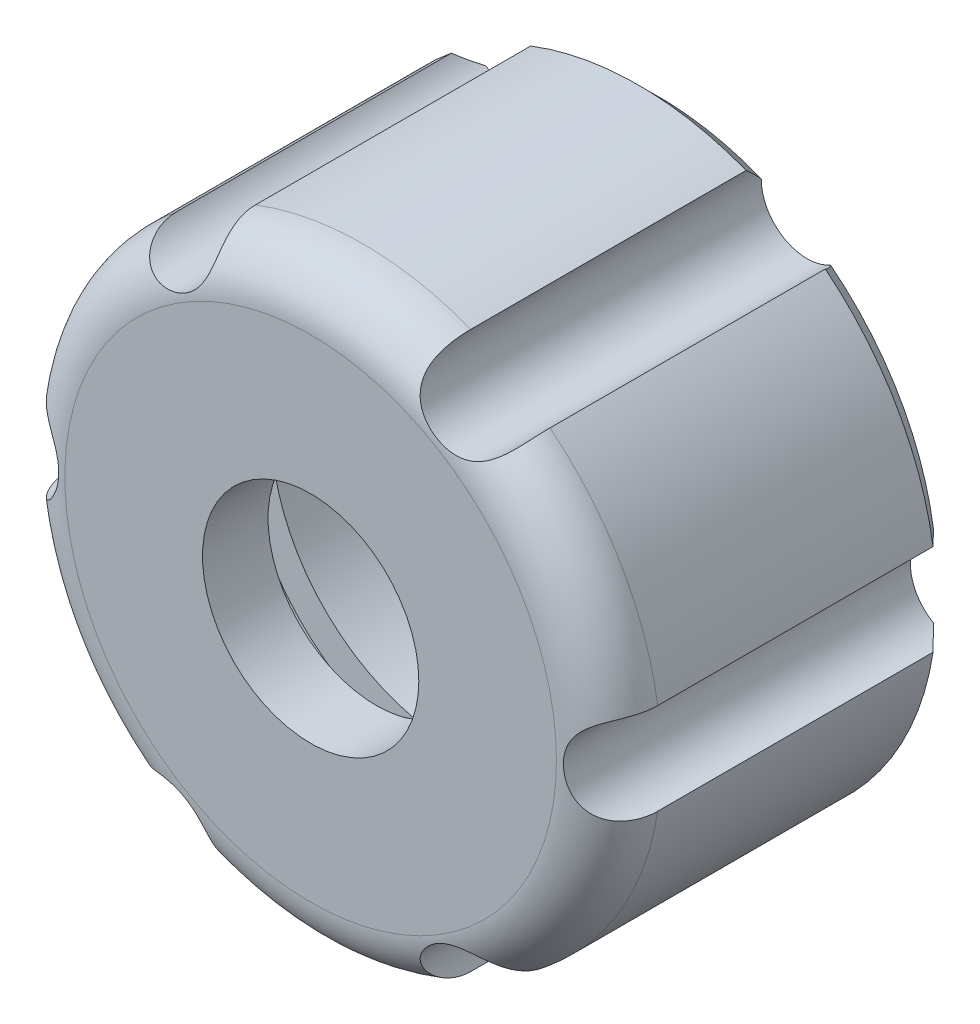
ISO-10303-21;
HEADER;
FILE_DESCRIPTION(('STEP AP214'),'2;1');
FILE_NAME('part.step','',(''),(''),'','','');
FILE_SCHEMA(('AUTOMOTIVE_DESIGN { 1 0 10303 214 1 1 1 1 }'));
ENDSEC;
DATA;
#1=APPLICATION_CONTEXT('core data for automotive mechanical design processes');
#2=APPLICATION_PROTOCOL_DEFINITION('international standard','automotive_design',2000,#1);
#3=PRODUCT_CONTEXT('',#1,'mechanical');
#4=PRODUCT('Part','Part','',(#3));
#5=PRODUCT_RELATED_PRODUCT_CATEGORY('part','',(#4));
#6=PRODUCT_DEFINITION_FORMATION('','',#4);
#7=PRODUCT_DEFINITION_CONTEXT('part definition',#1,'design');
#8=PRODUCT_DEFINITION('design','',#6,#7);
#9=PRODUCT_DEFINITION_SHAPE('','',#8);
#10=(LENGTH_UNIT() NAMED_UNIT(*) SI_UNIT(.MILLI.,.METRE.));
#11=(NAMED_UNIT(*) PLANE_ANGLE_UNIT() SI_UNIT($,.RADIAN.));
#12=(NAMED_UNIT(*) SI_UNIT($,.STERADIAN.) SOLID_ANGLE_UNIT());
#13=UNCERTAINTY_MEASURE_WITH_UNIT(LENGTH_MEASURE(1.E-05),#10,'distance_accuracy_value','');
#14=(GEOMETRIC_REPRESENTATION_CONTEXT(3) GLOBAL_UNCERTAINTY_ASSIGNED_CONTEXT((#13)) GLOBAL_UNIT_ASSIGNED_CONTEXT((#10,
#11,#12)) REPRESENTATION_CONTEXT('',''));
#15=CARTESIAN_POINT('',(0.,0.,0.));
#16=DIRECTION('',(0.,0.,1.));
#17=DIRECTION('',(1.,0.,0.));
#18=AXIS2_PLACEMENT_3D('',#15,#16,#17);
#19=CARTESIAN_POINT('',(0.,0.,-26.5));
#20=DIRECTION('',(0.,0.,1.));
#21=DIRECTION('',(1.,0.,0.));
#22=AXIS2_PLACEMENT_3D('',#19,#20,#21);
#23=CYLINDRICAL_SURFACE('',#22,22.75);
#24=DIRECTION('',(0.,0.,1.));
#25=VECTOR('',#24,1.);
#26=CARTESIAN_POINT('',(14.2624925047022,-17.724102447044,-13.25));
#27=LINE('',#26,#25);
#28=CARTESIAN_POINT('',(14.2624925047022,-17.724102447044,-25.));
#29=VERTEX_POINT('',#28);
#30=CARTESIAN_POINT('',(14.2624925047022,-17.724102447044,-4.));
#31=VERTEX_POINT('',#30);
#32=EDGE_CURVE('E348',#29,#31,#27,.T.);
#33=ORIENTED_EDGE('',*,*,#32,.F.);
#34=CARTESIAN_POINT('',(0.,0.,-25.));
#35=DIRECTION('',(0.,0.,1.));
#36=DIRECTION('',(1.,0.,0.));
#37=AXIS2_PLACEMENT_3D('',#34,#35,#36);
#38=CIRCLE('',#37,22.75);
#39=CARTESIAN_POINT('',(22.4807692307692,-3.48962960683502,-25.));
#40=VERTEX_POINT('',#39);
#41=EDGE_CURVE('E318',#29,#40,#38,.T.);
#42=ORIENTED_EDGE('',*,*,#41,.T.);
#43=DIRECTION('',(0.,0.,1.));
#44=VECTOR('',#43,1.);
#45=CARTESIAN_POINT('',(22.4807692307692,-3.489629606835,-13.25));
#46=LINE('',#45,#44);
#47=CARTESIAN_POINT('',(22.4807692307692,-3.489629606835,-4.));
#48=VERTEX_POINT('',#47);
#49=EDGE_CURVE('E213',#48,#40,#46,.F.);
#50=ORIENTED_EDGE('',*,*,#49,.F.);
#51=CARTESIAN_POINT('',(0.,0.,-4.));
#52=DIRECTION('',(0.,0.,1.));
#53=DIRECTION('',(1.,0.,0.));
#54=AXIS2_PLACEMENT_3D('',#51,#52,#53);
#55=CIRCLE('',#54,22.75);
#56=EDGE_CURVE('E315',#48,#31,#55,.F.);
#57=ORIENTED_EDGE('',*,*,#56,.T.);
#58=EDGE_LOOP('',(#33,#42,#50,#57));
#59=FACE_BOUND('',#58,.T.);
#60=ADVANCED_FACE('F36',(#59),#23,.T.);
#61=CARTESIAN_POINT('',(0.,0.,-25.));
#62=DIRECTION('',(0.,0.,1.));
#63=DIRECTION('',(1.,0.,0.));
#64=AXIS2_PLACEMENT_3D('',#61,#62,#63);
#65=CONICAL_SURFACE('',#64,22.75,0.785398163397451);
#66=CARTESIAN_POINT('',(8.21836336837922,-21.21391297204,-24.9997999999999));
#67=CARTESIAN_POINT('',(8.16361830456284,-21.0995444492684,-25.1262092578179));
#68=CARTESIAN_POINT('',(8.11515481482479,-20.982467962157,-25.2528930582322));
#69=CARTESIAN_POINT('',(8.03139123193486,-20.7442717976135,-25.5052723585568));
#70=CARTESIAN_POINT('',(7.99601296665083,-20.6231810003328,-25.6309691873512));
#71=CARTESIAN_POINT('',(7.93834495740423,-20.3769144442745,-25.8814008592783));
#72=CARTESIAN_POINT('',(7.91605619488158,-20.2517383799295,-26.0061356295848));
#73=CARTESIAN_POINT('',(7.88509461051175,-19.997103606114,-26.2544650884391));
#74=CARTESIAN_POINT('',(7.87650585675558,-19.8676233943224,-26.3780481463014));
#75=CARTESIAN_POINT('',(7.87517083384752,-19.7366583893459,-26.5001999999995));
#76=B_SPLINE_CURVE_WITH_KNOTS('',3,(#66,#67,#68,#69,#70,#71,#72,#73,#74,#75),.UNSPECIFIED.,.F.,
.F.,(4,2,2,2,4),(0.,0.537001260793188,1.07074053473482,1.60451982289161,2.14156214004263),.UNSPECIFIED.);
#77=CARTESIAN_POINT('',(8.21827672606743,-21.2137320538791,-25.));
#78=VERTEX_POINT('',#77);
#79=CARTESIAN_POINT('',(7.87517295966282,-19.7368728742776,-26.5));
#80=VERTEX_POINT('',#79);
#81=EDGE_CURVE('E164',#78,#80,#76,.T.);
#82=ORIENTED_EDGE('',*,*,#81,.F.);
#83=CARTESIAN_POINT('',(-8.21827672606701,-21.2137320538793,-25.));
#84=VERTEX_POINT('',#83);
#85=EDGE_CURVE('E499',#84,#78,#38,.T.);
#86=ORIENTED_EDGE('',*,*,#85,.F.);
#87=CARTESIAN_POINT('',(-7.87517083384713,-19.736658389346,-26.5001999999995));
#88=CARTESIAN_POINT('',(-7.87650585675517,-19.8676233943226,-26.3780481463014));
#89=CARTESIAN_POINT('',(-7.88509461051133,-19.9971036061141,-26.2544650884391));
#90=CARTESIAN_POINT('',(-7.91605619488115,-20.2517383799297,-26.0061356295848));
#91=CARTESIAN_POINT('',(-7.9383449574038,-20.3769144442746,-25.8814008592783));
#92=CARTESIAN_POINT('',(-7.9960129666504,-20.623181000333,-25.6309691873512));
#93=CARTESIAN_POINT('',(-8.03139123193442,-20.7442717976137,-25.5052723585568));
#94=CARTESIAN_POINT('',(-8.11515481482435,-20.9824679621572,-25.2528930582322));
#95=CARTESIAN_POINT('',(-8.1636183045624,-21.0995444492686,-25.1262092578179));
#96=CARTESIAN_POINT('',(-8.21836336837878,-21.2139129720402,-24.9997999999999));
#97=B_SPLINE_CURVE_WITH_KNOTS('',3,(#87,#88,#89,#90,#91,#92,#93,#94,#95,#96),.UNSPECIFIED.,.F.,
.F.,(4,2,2,2,4),(0.,0.537042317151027,1.07082160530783,1.60456087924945,2.14156214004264),.UNSPECIFIED.);
#98=CARTESIAN_POINT('',(-7.8751729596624,-19.7368728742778,-26.5));
#99=VERTEX_POINT('',#98);
#100=EDGE_CURVE('E182',#99,#84,#97,.T.);
#101=ORIENTED_EDGE('',*,*,#100,.F.);
#102=CARTESIAN_POINT('',(0.,0.,-26.5));
#103=DIRECTION('',(0.,0.,1.));
#104=DIRECTION('',(1.,0.,0.));
#105=AXIS2_PLACEMENT_3D('',#102,#103,#104);
#106=CIRCLE('',#105,21.25);
#107=EDGE_CURVE('E63',#80,#99,#106,.F.);
#108=ORIENTED_EDGE('',*,*,#107,.F.);
#109=EDGE_LOOP('',(#82,#86,#101,#108));
#110=FACE_BOUND('',#109,.T.);
#111=ADVANCED_FACE('F181',(#110),#65,.T.);
#112=DIRECTION('',(0.,0.,1.));
#113=VECTOR('',#112,1.);
#114=CARTESIAN_POINT('',(8.21827672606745,-21.2137320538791,-13.25));
#115=LINE('',#114,#113);
#116=CARTESIAN_POINT('',(8.21827672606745,-21.2137320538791,-4.));
#117=VERTEX_POINT('',#116);
#118=EDGE_CURVE('E167',#117,#78,#115,.F.);
#119=ORIENTED_EDGE('',*,*,#118,.F.);
#120=CARTESIAN_POINT('',(-8.21827672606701,-21.2137320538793,-4.));
#121=VERTEX_POINT('',#120);
#122=EDGE_CURVE('E319',#117,#121,#55,.F.);
#123=ORIENTED_EDGE('',*,*,#122,.T.);
#124=DIRECTION('',(0.,0.,1.));
#125=VECTOR('',#124,1.);
#126=CARTESIAN_POINT('',(-8.21827672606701,-21.2137320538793,-13.25));
#127=LINE('',#126,#125);
#128=EDGE_CURVE('E395',#84,#121,#127,.T.);
#129=ORIENTED_EDGE('',*,*,#128,.F.);
#130=ORIENTED_EDGE('',*,*,#85,.T.);
#131=EDGE_LOOP('',(#119,#123,#129,#130));
#132=FACE_BOUND('',#131,.T.);
#133=ADVANCED_FACE('F254',(#132),#23,.T.);
#134=CARTESIAN_POINT('',(-14.2626058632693,-17.7242679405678,-24.9997999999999));
#135=CARTESIAN_POINT('',(-14.190932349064,-17.6196730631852,-25.1262092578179));
#136=CARTESIAN_POINT('',(-14.1137728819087,-17.5191642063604,-25.2528930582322));
#137=CARTESIAN_POINT('',(-13.949370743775,-17.3275247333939,-25.5052723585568));
#138=CARTESIAN_POINT('',(-13.8621921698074,-17.2363408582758,-25.6309691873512));
#139=CARTESIAN_POINT('',(-13.6777530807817,-17.0632656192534,-25.8814008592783));
#140=CARTESIAN_POINT('',(-13.5804918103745,-16.9813749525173,-26.0061356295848));
#141=CARTESIAN_POINT('',(-13.3754524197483,-16.8272440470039,-26.2544650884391));
#142=CARTESIAN_POINT('',(-13.2676136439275,-16.7550658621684,-26.3780481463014));
#143=CARTESIAN_POINT('',(-13.1548621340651,-16.6884271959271,-26.5001999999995));
#144=B_SPLINE_CURVE_WITH_KNOTS('',3,(#134,#135,#136,#137,#138,#139,#140,#141,#142,#143),
.UNSPECIFIED.,.F.,.F.,(4,2,2,2,4),(0.,0.537001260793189,1.07074053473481,1.60451982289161,
2.14156214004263),.UNSPECIFIED.);
#145=CARTESIAN_POINT('',(-14.2624925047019,-17.7241024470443,-25.));
#146=VERTEX_POINT('',#145);
#147=CARTESIAN_POINT('',(-13.155046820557,-16.6885362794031,-26.5));
#148=VERTEX_POINT('',#147);
#149=EDGE_CURVE('E384',#146,#148,#144,.T.);
#150=ORIENTED_EDGE('',*,*,#149,.F.);
#151=CARTESIAN_POINT('',(-22.4807692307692,-3.489629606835,-25.));
#152=VERTEX_POINT('',#151);
#153=EDGE_CURVE('E517',#152,#146,#38,.T.);
#154=ORIENTED_EDGE('',*,*,#153,.F.);
#155=CARTESIAN_POINT('',(-21.0300329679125,-3.04823119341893,-26.5001999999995));
#156=CARTESIAN_POINT('',(-21.144119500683,-3.11255753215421,-26.3780481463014));
#157=CARTESIAN_POINT('',(-21.2605470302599,-3.16985955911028,-26.2544650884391));
#158=CARTESIAN_POINT('',(-21.496548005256,-3.27036342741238,-26.0061356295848));
#159=CARTESIAN_POINT('',(-21.6160980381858,-3.31364882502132,-25.8814008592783));
#160=CARTESIAN_POINT('',(-21.8582051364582,-3.38684014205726,-25.6309691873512));
#161=CARTESIAN_POINT('',(-21.9807619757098,-3.41674706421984,-25.5052723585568));
#162=CARTESIAN_POINT('',(-22.2289276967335,-3.46330375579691,-25.2528930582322));
#163=CARTESIAN_POINT('',(-22.3545506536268,-3.4798713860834,-25.1262092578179));
#164=CARTESIAN_POINT('',(-22.4809692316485,-3.48964503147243,-24.9997999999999));
#165=B_SPLINE_CURVE_WITH_KNOTS('',3,(#155,#156,#157,#158,#159,#160,#161,#162,#163,#164),
.UNSPECIFIED.,.F.,.F.,(4,2,2,2,4),(0.,0.537042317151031,1.07082160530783,1.60456087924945,
2.14156214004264),.UNSPECIFIED.);
#166=CARTESIAN_POINT('',(-21.0302197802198,-3.04833659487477,-26.5));
#167=VERTEX_POINT('',#166);
#168=EDGE_CURVE('E423',#167,#152,#165,.T.);
#169=ORIENTED_EDGE('',*,*,#168,.F.);
#170=EDGE_CURVE('E183',#148,#167,#106,.F.);
#171=ORIENTED_EDGE('',*,*,#170,.F.);
#172=EDGE_LOOP('',(#150,#154,#169,#171));
#173=FACE_BOUND('',#172,.T.);
#174=ADVANCED_FACE('F258',(#173),#65,.T.);
#175=DIRECTION('',(0.,0.,1.));
#176=VECTOR('',#175,1.);
#177=CARTESIAN_POINT('',(-14.2624925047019,-17.7241024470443,-13.25));
#178=LINE('',#177,#176);
#179=CARTESIAN_POINT('',(-14.2624925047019,-17.7241024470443,-4.));
#180=VERTEX_POINT('',#179);
#181=EDGE_CURVE('E403',#180,#146,#178,.F.);
#182=ORIENTED_EDGE('',*,*,#181,.F.);
#183=CARTESIAN_POINT('',(-22.4807692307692,-3.489629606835,-4.));
#184=VERTEX_POINT('',#183);
#185=EDGE_CURVE('E313',#180,#184,#55,.F.);
#186=ORIENTED_EDGE('',*,*,#185,.T.);
#187=DIRECTION('',(0.,0.,1.));
#188=VECTOR('',#187,1.);
#189=CARTESIAN_POINT('',(-22.4807692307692,-3.489629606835,-13.25));
#190=LINE('',#189,#188);
#191=EDGE_CURVE('E428',#152,#184,#190,.T.);
#192=ORIENTED_EDGE('',*,*,#191,.F.);
#193=ORIENTED_EDGE('',*,*,#153,.T.);
#194=EDGE_LOOP('',(#182,#186,#192,#193));
#195=FACE_BOUND('',#194,.T.);
#196=ADVANCED_FACE('F262',(#195),#23,.T.);
#197=CARTESIAN_POINT('',(-22.4809692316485,3.48964503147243,-24.9997999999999));
#198=CARTESIAN_POINT('',(-22.3545506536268,3.4798713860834,-25.1262092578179));
#199=CARTESIAN_POINT('',(-22.2289276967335,3.46330375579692,-25.2528930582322));
#200=CARTESIAN_POINT('',(-21.9807619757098,3.41674706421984,-25.5052723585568));
#201=CARTESIAN_POINT('',(-21.8582051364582,3.38684014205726,-25.6309691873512));
#202=CARTESIAN_POINT('',(-21.6160980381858,3.31364882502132,-25.8814008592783));
#203=CARTESIAN_POINT('',(-21.496548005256,3.27036342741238,-26.0061356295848));
#204=CARTESIAN_POINT('',(-21.2605470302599,3.16985955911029,-26.2544650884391));
#205=CARTESIAN_POINT('',(-21.144119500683,3.11255753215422,-26.3780481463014));
#206=CARTESIAN_POINT('',(-21.0300329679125,3.04823119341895,-26.5001999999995));
#207=B_SPLINE_CURVE_WITH_KNOTS('',3,(#197,#198,#199,#200,#201,#202,#203,#204,#205,#206),
.UNSPECIFIED.,.F.,.F.,(4,2,2,2,4),(0.,0.537001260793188,1.07074053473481,1.60451982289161,
2.14156214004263),.UNSPECIFIED.);
#208=CARTESIAN_POINT('',(-22.4807692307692,3.48962960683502,-25.));
#209=VERTEX_POINT('',#208);
#210=CARTESIAN_POINT('',(-21.0302197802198,3.04833659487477,-26.5));
#211=VERTEX_POINT('',#210);
#212=EDGE_CURVE('E416',#209,#211,#207,.T.);
#213=ORIENTED_EDGE('',*,*,#212,.F.);
#214=CARTESIAN_POINT('',(-14.2624925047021,17.7241024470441,-25.));
#215=VERTEX_POINT('',#214);
#216=EDGE_CURVE('E516',#215,#209,#38,.T.);
#217=ORIENTED_EDGE('',*,*,#216,.F.);
#218=CARTESIAN_POINT('',(-13.1548621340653,16.688427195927,-26.5001999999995));
#219=CARTESIAN_POINT('',(-13.2676136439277,16.7550658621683,-26.3780481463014));
#220=CARTESIAN_POINT('',(-13.3754524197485,16.8272440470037,-26.2544650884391));
#221=CARTESIAN_POINT('',(-13.5804918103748,16.9813749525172,-26.0061356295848));
#222=CARTESIAN_POINT('',(-13.6777530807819,17.0632656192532,-25.8814008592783));
#223=CARTESIAN_POINT('',(-13.8621921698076,17.2363408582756,-25.6309691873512));
#224=CARTESIAN_POINT('',(-13.9493707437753,17.3275247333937,-25.5052723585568));
#225=CARTESIAN_POINT('',(-14.113772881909,17.5191642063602,-25.2528930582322));
#226=CARTESIAN_POINT('',(-14.1909323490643,17.6196730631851,-25.1262092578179));
#227=CARTESIAN_POINT('',(-14.2626058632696,17.7242679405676,-24.9997999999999));
#228=B_SPLINE_CURVE_WITH_KNOTS('',3,(#218,#219,#220,#221,#222,#223,#224,#225,#226,#227),
.UNSPECIFIED.,.F.,.F.,(4,2,2,2,4),(0.,0.537042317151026,1.07082160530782,1.60456087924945,
2.14156214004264),.UNSPECIFIED.);
#229=CARTESIAN_POINT('',(-13.1550468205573,16.6885362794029,-26.5));
#230=VERTEX_POINT('',#229);
#231=EDGE_CURVE('E454',#230,#215,#228,.T.);
#232=ORIENTED_EDGE('',*,*,#231,.F.);
#233=EDGE_CURVE('E186',#211,#230,#106,.F.);
#234=ORIENTED_EDGE('',*,*,#233,.F.);
#235=EDGE_LOOP('',(#213,#217,#232,#234));
#236=FACE_BOUND('',#235,.T.);
#237=ADVANCED_FACE('F267',(#236),#65,.T.);
#238=DIRECTION('',(0.,0.,1.));
#239=VECTOR('',#238,1.);
#240=CARTESIAN_POINT('',(-22.4807692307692,3.489629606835,-13.25));
#241=LINE('',#240,#239);
#242=CARTESIAN_POINT('',(-22.4807692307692,3.489629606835,-4.));
#243=VERTEX_POINT('',#242);
#244=EDGE_CURVE('E436',#243,#209,#241,.F.);
#245=ORIENTED_EDGE('',*,*,#244,.F.);
#246=CARTESIAN_POINT('',(-14.2624925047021,17.7241024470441,-4.));
#247=VERTEX_POINT('',#246);
#248=EDGE_CURVE('E311',#243,#247,#55,.F.);
#249=ORIENTED_EDGE('',*,*,#248,.T.);
#250=DIRECTION('',(0.,0.,1.));
#251=VECTOR('',#250,1.);
#252=CARTESIAN_POINT('',(-14.2624925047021,17.7241024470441,-13.25));
#253=LINE('',#252,#251);
#254=EDGE_CURVE('E459',#215,#247,#253,.T.);
#255=ORIENTED_EDGE('',*,*,#254,.F.);
#256=ORIENTED_EDGE('',*,*,#216,.T.);
#257=EDGE_LOOP('',(#245,#249,#255,#256));
#258=FACE_BOUND('',#257,.T.);
#259=ADVANCED_FACE('F270',(#258),#23,.T.);
#260=CARTESIAN_POINT('',(-8.21836336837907,21.2139129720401,-24.9997999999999));
#261=CARTESIAN_POINT('',(-8.1636183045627,21.0995444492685,-25.1262092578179));
#262=CARTESIAN_POINT('',(-8.11515481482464,20.9824679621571,-25.2528930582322));
#263=CARTESIAN_POINT('',(-8.03139123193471,20.7442717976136,-25.5052723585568));
#264=CARTESIAN_POINT('',(-7.99601296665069,20.6231810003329,-25.6309691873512));
#265=CARTESIAN_POINT('',(-7.93834495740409,20.3769144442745,-25.8814008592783));
#266=CARTESIAN_POINT('',(-7.91605619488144,20.2517383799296,-26.0061356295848));
#267=CARTESIAN_POINT('',(-7.88509461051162,19.997103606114,-26.2544650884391));
#268=CARTESIAN_POINT('',(-7.87650585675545,19.8676233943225,-26.3780481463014));
#269=CARTESIAN_POINT('',(-7.87517083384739,19.7366583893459,-26.5001999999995));
#270=B_SPLINE_CURVE_WITH_KNOTS('',3,(#260,#261,#262,#263,#264,#265,#266,#267,#268,#269),
.UNSPECIFIED.,.F.,.F.,(4,2,2,2,4),(0.,0.537001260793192,1.07074053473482,1.60451982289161,
2.14156214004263),.UNSPECIFIED.);
#271=CARTESIAN_POINT('',(-8.21827672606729,21.2137320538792,-25.));
#272=VERTEX_POINT('',#271);
#273=CARTESIAN_POINT('',(-7.87517295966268,19.7368728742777,-26.5));
#274=VERTEX_POINT('',#273);
#275=EDGE_CURVE('E447',#272,#274,#270,.T.);
#276=ORIENTED_EDGE('',*,*,#275,.F.);
#277=CARTESIAN_POINT('',(8.21827672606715,21.2137320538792,-25.));
#278=VERTEX_POINT('',#277);
#279=EDGE_CURVE('E298',#278,#272,#38,.T.);
#280=ORIENTED_EDGE('',*,*,#279,.F.);
#281=CARTESIAN_POINT('',(7.87517083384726,19.736658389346,-26.5001999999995));
#282=CARTESIAN_POINT('',(7.87650585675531,19.8676233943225,-26.3780481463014));
#283=CARTESIAN_POINT('',(7.88509461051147,19.9971036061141,-26.2544650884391));
#284=CARTESIAN_POINT('',(7.91605619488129,20.2517383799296,-26.0061356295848));
#285=CARTESIAN_POINT('',(7.93834495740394,20.3769144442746,-25.8814008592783));
#286=CARTESIAN_POINT('',(7.99601296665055,20.6231810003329,-25.6309691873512));
#287=CARTESIAN_POINT('',(8.03139123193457,20.7442717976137,-25.5052723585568));
#288=CARTESIAN_POINT('',(8.11515481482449,20.9824679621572,-25.2528930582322));
#289=CARTESIAN_POINT('',(8.16361830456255,21.0995444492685,-25.1262092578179));
#290=CARTESIAN_POINT('',(8.21836336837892,21.2139129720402,-24.9997999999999));
#291=B_SPLINE_CURVE_WITH_KNOTS('',3,(#281,#282,#283,#284,#285,#286,#287,#288,#289,#290),
.UNSPECIFIED.,.F.,.F.,(4,2,2,2,4),(0.,0.537042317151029,1.07082160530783,1.60456087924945,
2.14156214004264),.UNSPECIFIED.);
#292=CARTESIAN_POINT('',(7.87517295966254,19.7368728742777,-26.5));
#293=VERTEX_POINT('',#292);
#294=EDGE_CURVE('E480',#293,#278,#291,.T.);
#295=ORIENTED_EDGE('',*,*,#294,.F.);
#296=EDGE_CURVE('E519',#274,#293,#106,.F.);
#297=ORIENTED_EDGE('',*,*,#296,.F.);
#298=EDGE_LOOP('',(#276,#280,#295,#297));
#299=FACE_BOUND('',#298,.T.);
#300=ADVANCED_FACE('F275',(#299),#65,.T.);
#301=DIRECTION('',(0.,0.,1.));
#302=VECTOR('',#301,1.);
#303=CARTESIAN_POINT('',(-8.2182767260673,21.2137320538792,-13.25));
#304=LINE('',#303,#302);
#305=CARTESIAN_POINT('',(-8.2182767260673,21.2137320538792,-4.));
#306=VERTEX_POINT('',#305);
#307=EDGE_CURVE('E292',#306,#272,#304,.F.);
#308=ORIENTED_EDGE('',*,*,#307,.F.);
#309=CARTESIAN_POINT('',(8.21827672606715,21.2137320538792,-4.));
#310=VERTEX_POINT('',#309);
#311=EDGE_CURVE('E295',#306,#310,#55,.F.);
#312=ORIENTED_EDGE('',*,*,#311,.T.);
#313=DIRECTION('',(0.,0.,1.));
#314=VECTOR('',#313,1.);
#315=CARTESIAN_POINT('',(8.21827672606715,21.2137320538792,-13.25));
#316=LINE('',#315,#314);
#317=EDGE_CURVE('E485',#278,#310,#316,.T.);
#318=ORIENTED_EDGE('',*,*,#317,.F.);
#319=ORIENTED_EDGE('',*,*,#279,.T.);
#320=EDGE_LOOP('',(#308,#312,#318,#319));
#321=FACE_BOUND('',#320,.T.);
#322=ADVANCED_FACE('F227',(#321),#23,.T.);
#323=CARTESIAN_POINT('',(14.2626058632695,17.7242679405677,-24.9997999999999));
#324=CARTESIAN_POINT('',(14.1909323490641,17.6196730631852,-25.1262092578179));
#325=CARTESIAN_POINT('',(14.1137728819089,17.5191642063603,-25.2528930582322));
#326=CARTESIAN_POINT('',(13.9493707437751,17.3275247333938,-25.5052723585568));
#327=CARTESIAN_POINT('',(13.8621921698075,17.2363408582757,-25.6309691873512));
#328=CARTESIAN_POINT('',(13.6777530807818,17.0632656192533,-25.8814008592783));
#329=CARTESIAN_POINT('',(13.5804918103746,16.9813749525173,-26.0061356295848));
#330=CARTESIAN_POINT('',(13.3754524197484,16.8272440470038,-26.2544650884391));
#331=CARTESIAN_POINT('',(13.2676136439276,16.7550658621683,-26.3780481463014));
#332=CARTESIAN_POINT('',(13.1548621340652,16.6884271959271,-26.5001999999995));
#333=B_SPLINE_CURVE_WITH_KNOTS('',3,(#323,#324,#325,#326,#327,#328,#329,#330,#331,#332),
.UNSPECIFIED.,.F.,.F.,(4,2,2,2,4),(0.,0.537001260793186,1.07074053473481,1.60451982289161,
2.14156214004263),.UNSPECIFIED.);
#334=CARTESIAN_POINT('',(14.262492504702,17.7241024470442,-25.));
#335=VERTEX_POINT('',#334);
#336=CARTESIAN_POINT('',(13.1550468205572,16.688536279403,-26.5));
#337=VERTEX_POINT('',#336);
#338=EDGE_CURVE('E301',#335,#337,#333,.T.);
#339=ORIENTED_EDGE('',*,*,#338,.F.);
#340=CARTESIAN_POINT('',(22.4807692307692,3.489629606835,-25.));
#341=VERTEX_POINT('',#340);
#342=EDGE_CURVE('E188',#341,#335,#38,.T.);
#343=ORIENTED_EDGE('',*,*,#342,.F.);
#344=CARTESIAN_POINT('',(21.0300329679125,3.04823119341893,-26.5001999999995));
#345=CARTESIAN_POINT('',(21.144119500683,3.11255753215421,-26.3780481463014));
#346=CARTESIAN_POINT('',(21.2605470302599,3.16985955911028,-26.2544650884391));
#347=CARTESIAN_POINT('',(21.496548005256,3.27036342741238,-26.0061356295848));
#348=CARTESIAN_POINT('',(21.6160980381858,3.31364882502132,-25.8814008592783));
#349=CARTESIAN_POINT('',(21.8582051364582,3.38684014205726,-25.6309691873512));
#350=CARTESIAN_POINT('',(21.9807619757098,3.41674706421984,-25.5052723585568));
#351=CARTESIAN_POINT('',(22.2289276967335,3.46330375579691,-25.2528930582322));
#352=CARTESIAN_POINT('',(22.3545506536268,3.4798713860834,-25.1262092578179));
#353=CARTESIAN_POINT('',(22.4809692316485,3.48964503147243,-24.9997999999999));
#354=B_SPLINE_CURVE_WITH_KNOTS('',3,(#344,#345,#346,#347,#348,#349,#350,#351,#352,#353),
.UNSPECIFIED.,.F.,.F.,(4,2,2,2,4),(0.,0.537042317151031,1.07082160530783,1.60456087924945,
2.14156214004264),.UNSPECIFIED.);
#355=CARTESIAN_POINT('',(21.0302197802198,3.04833659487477,-26.5));
#356=VERTEX_POINT('',#355);
#357=EDGE_CURVE('E49',#356,#341,#354,.T.);
#358=ORIENTED_EDGE('',*,*,#357,.F.);
#359=EDGE_CURVE('E185',#337,#356,#106,.F.);
#360=ORIENTED_EDGE('',*,*,#359,.F.);
#361=EDGE_LOOP('',(#339,#343,#358,#360));
#362=FACE_BOUND('',#361,.T.);
#363=ADVANCED_FACE('F242',(#362),#65,.T.);
#364=CARTESIAN_POINT('',(0.,0.,34.5979797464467));
#365=DIRECTION('',(0.,0.,-1.));
#366=DIRECTION('',(-1.,0.,0.));
#367=AXIS2_PLACEMENT_3D('',#364,#365,#366);
#368=CYLINDRICAL_SURFACE('',#367,14.);
#369=CARTESIAN_POINT('',(0.,0.,-26.5));
#370=DIRECTION('',(0.,0.,-1.));
#371=DIRECTION('',(-1.,0.,0.));
#372=AXIS2_PLACEMENT_3D('',#369,#370,#371);
#373=CIRCLE('',#372,14.);
#374=CARTESIAN_POINT('',(-14.,0.,-26.5));
#375=VERTEX_POINT('',#374);
#376=EDGE_CURVE('E322',#375,#375,#373,.T.);
#377=ORIENTED_EDGE('',*,*,#376,.T.);
#378=EDGE_LOOP('',(#377));
#379=FACE_BOUND('',#378,.T.);
#380=CARTESIAN_POINT('',(0.,0.,-11.));
#381=DIRECTION('',(0.,0.,1.));
#382=DIRECTION('',(1.,0.,0.));
#383=AXIS2_PLACEMENT_3D('',#380,#381,#382);
#384=CIRCLE('',#383,14.);
#385=CARTESIAN_POINT('',(14.,0.,-11.));
#386=VERTEX_POINT('',#385);
#387=EDGE_CURVE('E328',#386,#386,#384,.F.);
#388=ORIENTED_EDGE('',*,*,#387,.F.);
#389=EDGE_LOOP('',(#388));
#390=FACE_BOUND('',#389,.T.);
#391=ADVANCED_FACE('F225',(#379,#390),#368,.F.);
#392=DIRECTION('',(0.,0.,1.));
#393=VECTOR('',#392,1.);
#394=CARTESIAN_POINT('',(14.262492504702,17.7241024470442,-13.25));
#395=LINE('',#394,#393);
#396=CARTESIAN_POINT('',(14.262492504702,17.7241024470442,-4.));
#397=VERTEX_POINT('',#396);
#398=EDGE_CURVE('E491',#397,#335,#395,.F.);
#399=ORIENTED_EDGE('',*,*,#398,.F.);
#400=CARTESIAN_POINT('',(22.4807692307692,3.489629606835,-4.));
#401=VERTEX_POINT('',#400);
#402=EDGE_CURVE('E312',#397,#401,#55,.F.);
#403=ORIENTED_EDGE('',*,*,#402,.T.);
#404=DIRECTION('',(0.,0.,1.));
#405=VECTOR('',#404,1.);
#406=CARTESIAN_POINT('',(22.4807692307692,3.489629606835,-13.25));
#407=LINE('',#406,#405);
#408=EDGE_CURVE('E214',#341,#401,#407,.T.);
#409=ORIENTED_EDGE('',*,*,#408,.F.);
#410=ORIENTED_EDGE('',*,*,#342,.T.);
#411=EDGE_LOOP('',(#399,#403,#409,#410));
#412=FACE_BOUND('',#411,.T.);
#413=ADVANCED_FACE('F222',(#412),#23,.T.);
#414=CARTESIAN_POINT('',(0.,0.,-26.5));
#415=DIRECTION('',(0.,0.,1.));
#416=DIRECTION('',(1.,0.,0.));
#417=AXIS2_PLACEMENT_3D('',#414,#415,#416);
#418=PLANE('',#417);
#419=CARTESIAN_POINT('',(21.0302197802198,-3.04833659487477,-26.5));
#420=VERTEX_POINT('',#419);
#421=CARTESIAN_POINT('',(13.1550468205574,-16.6885362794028,-26.5));
#422=VERTEX_POINT('',#421);
#423=EDGE_CURVE('E177',#420,#422,#106,.F.);
#424=ORIENTED_EDGE('',*,*,#423,.T.);
#425=CARTESIAN_POINT('',(11.3750000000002,-19.7020779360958,-26.5));
#426=DIRECTION('',(0.,0.,1.));
#427=DIRECTION('',(0.50000000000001,-0.866025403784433,0.));
#428=AXIS2_PLACEMENT_3D('',#425,#426,#427);
#429=CIRCLE('',#428,3.5);
#430=EDGE_CURVE('E56',#422,#80,#429,.T.);
#431=ORIENTED_EDGE('',*,*,#430,.T.);
#432=ORIENTED_EDGE('',*,*,#107,.T.);
#433=CARTESIAN_POINT('',(-11.3749999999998,-19.7020779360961,-26.5));
#434=DIRECTION('',(0.,0.,1.));
#435=DIRECTION('',(-0.499999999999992,-0.866025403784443,0.));
#436=AXIS2_PLACEMENT_3D('',#433,#434,#435);
#437=CIRCLE('',#436,3.5);
#438=EDGE_CURVE('E396',#99,#148,#437,.T.);
#439=ORIENTED_EDGE('',*,*,#438,.T.);
#440=ORIENTED_EDGE('',*,*,#170,.T.);
#441=CARTESIAN_POINT('',(-22.75,0.,-26.5));
#442=DIRECTION('',(0.,0.,1.));
#443=DIRECTION('',(-1.,0.,0.));
#444=AXIS2_PLACEMENT_3D('',#441,#442,#443);
#445=CIRCLE('',#444,3.5);
#446=EDGE_CURVE('E429',#167,#211,#445,.T.);
#447=ORIENTED_EDGE('',*,*,#446,.T.);
#448=ORIENTED_EDGE('',*,*,#233,.T.);
#449=CARTESIAN_POINT('',(-11.3750000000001,19.7020779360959,-26.5));
#450=DIRECTION('',(0.,0.,1.));
#451=DIRECTION('',(-0.500000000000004,0.866025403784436,0.));
#452=AXIS2_PLACEMENT_3D('',#449,#450,#451);
#453=CIRCLE('',#452,3.5);
#454=EDGE_CURVE('E460',#230,#274,#453,.T.);
#455=ORIENTED_EDGE('',*,*,#454,.T.);
#456=ORIENTED_EDGE('',*,*,#296,.T.);
#457=CARTESIAN_POINT('',(11.375,19.702077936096,-26.5));
#458=DIRECTION('',(0.,0.,1.));
#459=DIRECTION('',(0.499999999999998,0.86602540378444,0.));
#460=AXIS2_PLACEMENT_3D('',#457,#458,#459);
#461=CIRCLE('',#460,3.5);
#462=EDGE_CURVE('E486',#293,#337,#461,.T.);
#463=ORIENTED_EDGE('',*,*,#462,.T.);
#464=ORIENTED_EDGE('',*,*,#359,.T.);
#465=CARTESIAN_POINT('',(22.75,0.,-26.5));
#466=DIRECTION('',(0.,0.,1.));
#467=DIRECTION('',(1.,0.,0.));
#468=AXIS2_PLACEMENT_3D('',#465,#466,#467);
#469=CIRCLE('',#468,3.5);
#470=EDGE_CURVE('E492',#356,#420,#469,.T.);
#471=ORIENTED_EDGE('',*,*,#470,.T.);
#472=EDGE_LOOP('',(#424,#431,#432,#439,#440,#447,#448,#455,#456,#463,#464,#471));
#473=FACE_BOUND('',#472,.T.);
#474=ORIENTED_EDGE('',*,*,#376,.F.);
#475=EDGE_LOOP('',(#474));
#476=FACE_BOUND('',#475,.T.);
#477=ADVANCED_FACE('F173',(#473,#476),#418,.F.);
#478=CARTESIAN_POINT('',(0.,0.,0.));
#479=DIRECTION('',(0.,0.,1.));
#480=DIRECTION('',(1.,0.,0.));
#481=AXIS2_PLACEMENT_3D('',#478,#479,#480);
#482=PLANE('',#481);
#483=CARTESIAN_POINT('',(0.,0.,0.));
#484=DIRECTION('',(0.,0.,1.));
#485=DIRECTION('',(1.,0.,0.));
#486=AXIS2_PLACEMENT_3D('',#483,#484,#485);
#487=CIRCLE('',#486,18.75);
#488=CARTESIAN_POINT('',(18.75,0.,0.));
#489=VERTEX_POINT('',#488);
#490=EDGE_CURVE('E314',#489,#489,#487,.T.);
#491=ORIENTED_EDGE('',*,*,#490,.T.);
#492=EDGE_LOOP('',(#491));
#493=FACE_BOUND('',#492,.T.);
#494=CARTESIAN_POINT('',(0.,0.,0.));
#495=DIRECTION('',(0.,0.,1.));
#496=DIRECTION('',(1.,0.,0.));
#497=AXIS2_PLACEMENT_3D('',#494,#495,#496);
#498=CIRCLE('',#497,8.25);
#499=CARTESIAN_POINT('',(8.25,0.,0.));
#500=VERTEX_POINT('',#499);
#501=EDGE_CURVE('E327',#500,#500,#498,.T.);
#502=ORIENTED_EDGE('',*,*,#501,.F.);
#503=EDGE_LOOP('',(#502));
#504=FACE_BOUND('',#503,.T.);
#505=ADVANCED_FACE('F228',(#493,#504),#482,.T.);
#506=CARTESIAN_POINT('',(0.,0.,-11.));
#507=DIRECTION('',(0.,0.,1.));
#508=DIRECTION('',(1.,0.,0.));
#509=AXIS2_PLACEMENT_3D('',#506,#507,#508);
#510=PLANE('',#509);
#511=CARTESIAN_POINT('',(0.,0.,-11.));
#512=DIRECTION('',(0.,0.,1.));
#513=DIRECTION('',(1.,0.,0.));
#514=AXIS2_PLACEMENT_3D('',#511,#512,#513);
#515=CIRCLE('',#514,16.5);
#516=CARTESIAN_POINT('',(16.5,0.,-11.));
#517=VERTEX_POINT('',#516);
#518=EDGE_CURVE('E331',#517,#517,#515,.T.);
#519=ORIENTED_EDGE('',*,*,#518,.T.);
#520=EDGE_LOOP('',(#519));
#521=FACE_BOUND('',#520,.T.);
#522=ORIENTED_EDGE('',*,*,#387,.T.);
#523=EDGE_LOOP('',(#522));
#524=FACE_BOUND('',#523,.T.);
#525=ADVANCED_FACE('F231',(#521,#524),#510,.T.);
#526=CARTESIAN_POINT('',(0.,0.,-11.));
#527=DIRECTION('',(0.,0.,1.));
#528=DIRECTION('',(1.,0.,0.));
#529=AXIS2_PLACEMENT_3D('',#526,#527,#528);
#530=CYLINDRICAL_SURFACE('',#529,16.5);
#531=ORIENTED_EDGE('',*,*,#518,.F.);
#532=EDGE_LOOP('',(#531));
#533=FACE_BOUND('',#532,.T.);
#534=CARTESIAN_POINT('',(0.,0.,-5.));
#535=DIRECTION('',(0.,0.,1.));
#536=DIRECTION('',(1.,0.,0.));
#537=AXIS2_PLACEMENT_3D('',#534,#535,#536);
#538=CIRCLE('',#537,16.5);
#539=CARTESIAN_POINT('',(16.5,0.,-5.));
#540=VERTEX_POINT('',#539);
#541=EDGE_CURVE('E326',#540,#540,#538,.T.);
#542=ORIENTED_EDGE('',*,*,#541,.T.);
#543=EDGE_LOOP('',(#542));
#544=FACE_BOUND('',#543,.T.);
#545=ADVANCED_FACE('F238',(#533,#544),#530,.F.);
#546=CARTESIAN_POINT('',(0.,0.,-5.));
#547=DIRECTION('',(0.,0.,1.));
#548=DIRECTION('',(1.,0.,0.));
#549=AXIS2_PLACEMENT_3D('',#546,#547,#548);
#550=PLANE('',#549);
#551=CARTESIAN_POINT('',(0.,0.,-5.));
#552=DIRECTION('',(0.,0.,1.));
#553=DIRECTION('',(1.,0.,0.));
#554=AXIS2_PLACEMENT_3D('',#551,#552,#553);
#555=CIRCLE('',#554,8.25);
#556=CARTESIAN_POINT('',(8.25,0.,-5.));
#557=VERTEX_POINT('',#556);
#558=EDGE_CURVE('E323',#557,#557,#555,.T.);
#559=ORIENTED_EDGE('',*,*,#558,.T.);
#560=EDGE_LOOP('',(#559));
#561=FACE_BOUND('',#560,.T.);
#562=ORIENTED_EDGE('',*,*,#541,.F.);
#563=EDGE_LOOP('',(#562));
#564=FACE_BOUND('',#563,.T.);
#565=ADVANCED_FACE('F235',(#561,#564),#550,.F.);
#566=CARTESIAN_POINT('',(0.,0.,-26.5));
#567=DIRECTION('',(0.,0.,1.));
#568=DIRECTION('',(1.,0.,0.));
#569=AXIS2_PLACEMENT_3D('',#566,#567,#568);
#570=CYLINDRICAL_SURFACE('',#569,8.25);
#571=ORIENTED_EDGE('',*,*,#501,.T.);
#572=EDGE_LOOP('',(#571));
#573=FACE_BOUND('',#572,.T.);
#574=ORIENTED_EDGE('',*,*,#558,.F.);
#575=EDGE_LOOP('',(#574));
#576=FACE_BOUND('',#575,.T.);
#577=ADVANCED_FACE('F202',(#573,#576),#570,.F.);
#578=CARTESIAN_POINT('',(0.,0.,-4.));
#579=DIRECTION('',(0.,0.,1.));
#580=DIRECTION('',(1.,0.,0.));
#581=AXIS2_PLACEMENT_3D('',#578,#579,#580);
#582=TOROIDAL_SURFACE('',#581,18.75,4.);
#583=CARTESIAN_POINT('',(14.2624925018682,-17.7241024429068,-4.0002));
#584=CARTESIAN_POINT('',(14.2624709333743,-17.7241422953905,-3.88810648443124));
#585=CARTESIAN_POINT('',(14.2598274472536,-17.720214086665,-3.77601630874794));
#586=CARTESIAN_POINT('',(14.2491178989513,-17.7046769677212,-3.5526365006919));
#587=CARTESIAN_POINT('',(14.2410521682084,-17.6930685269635,-3.44134681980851));
#588=CARTESIAN_POINT('',(14.2192937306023,-17.6623900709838,-3.22008662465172));
#589=CARTESIAN_POINT('',(14.2055877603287,-17.6433024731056,-3.1101198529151));
#590=CARTESIAN_POINT('',(14.1722012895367,-17.5981631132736,-2.89254867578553));
#591=CARTESIAN_POINT('',(14.1525208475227,-17.5721114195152,-2.78494424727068));
#592=CARTESIAN_POINT('',(14.1067082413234,-17.5136657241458,-2.57273383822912));
#593=CARTESIAN_POINT('',(14.0805686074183,-17.4812643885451,-2.468131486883));
#594=CARTESIAN_POINT('',(14.0213048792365,-17.4109683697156,-2.26282218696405));
#595=CARTESIAN_POINT('',(13.9881811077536,-17.3730739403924,-2.1621150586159));
#596=CARTESIAN_POINT('',(13.9144092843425,-17.2928531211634,-1.96553220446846));
#597=CARTESIAN_POINT('',(13.8737734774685,-17.2505339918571,-1.86964893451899));
#598=CARTESIAN_POINT('',(13.7843433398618,-17.1625909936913,-1.68336580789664));
#599=CARTESIAN_POINT('',(13.7355512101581,-17.1169680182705,-1.59296448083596));
#600=CARTESIAN_POINT('',(13.6407286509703,-17.0338301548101,-1.43728251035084));
#601=CARTESIAN_POINT('',(13.5963661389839,-16.9966849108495,-1.37078445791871));
#602=CARTESIAN_POINT('',(13.5021060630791,-16.9219637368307,-1.24210216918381));
#603=CARTESIAN_POINT('',(13.4522097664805,-16.8843879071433,-1.1799169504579));
#604=CARTESIAN_POINT('',(13.3468144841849,-16.8096539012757,-1.06029928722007));
#605=CARTESIAN_POINT('',(13.2913193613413,-16.772495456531,-1.0028636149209));
#606=CARTESIAN_POINT('',(13.1747286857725,-16.6994612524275,-0.893069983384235));
#607=CARTESIAN_POINT('',(13.113633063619,-16.6635855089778,-0.840712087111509));
#608=CARTESIAN_POINT('',(12.9856604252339,-16.5938449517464,-0.741090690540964));
#609=CARTESIAN_POINT('',(12.9187517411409,-16.559993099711,-0.693858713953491));
#610=CARTESIAN_POINT('',(12.7798367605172,-16.4954758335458,-0.605043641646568));
#611=CARTESIAN_POINT('',(12.7078304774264,-16.4648104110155,-0.563460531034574));
#612=CARTESIAN_POINT('',(12.5592786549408,-16.4075645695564,-0.486002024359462));
#613=CARTESIAN_POINT('',(12.4827336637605,-16.3809836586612,-0.450125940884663));
#614=CARTESIAN_POINT('',(12.3257941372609,-16.3326966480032,-0.383962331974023));
#615=CARTESIAN_POINT('',(12.2453998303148,-16.3109902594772,-0.353674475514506));
#616=CARTESIAN_POINT('',(12.0893503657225,-16.2749084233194,-0.301032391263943));
#617=CARTESIAN_POINT('',(12.0139722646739,-16.2600319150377,-0.278197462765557));
#618=CARTESIAN_POINT('',(11.8613148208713,-16.2351639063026,-0.236545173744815));
#619=CARTESIAN_POINT('',(11.784034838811,-16.2251740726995,-0.217729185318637));
#620=CARTESIAN_POINT('',(11.5502880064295,-16.2029798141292,-0.166750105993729));
#621=CARTESIAN_POINT('',(11.391810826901,-16.1985262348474,-0.140022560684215));
#622=CARTESIAN_POINT('',(11.0664125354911,-16.2117081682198,-0.0964929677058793));
#623=CARTESIAN_POINT('',(10.8994683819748,-16.2304682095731,-0.0802590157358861));
#624=CARTESIAN_POINT('',(10.5693516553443,-16.2919307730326,-0.0558508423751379));
#625=CARTESIAN_POINT('',(10.4061805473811,-16.3346424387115,-0.047679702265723));
#626=CARTESIAN_POINT('',(10.1586309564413,-16.4189112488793,-0.0389531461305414));
#627=CARTESIAN_POINT('',(10.0715140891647,-16.4525173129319,-0.0366267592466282));
#628=CARTESIAN_POINT('',(9.90019862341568,-16.5266000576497,-0.0332483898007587));
#629=CARTESIAN_POINT('',(9.81600021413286,-16.5670771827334,-0.032196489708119));
#630=CARTESIAN_POINT('',(9.65108065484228,-16.6546485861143,-0.0312062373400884));
#631=CARTESIAN_POINT('',(9.57036069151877,-16.7017450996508,-0.0312682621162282));
#632=CARTESIAN_POINT('',(9.41294921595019,-16.8022374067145,-0.032517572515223));
#633=CARTESIAN_POINT('',(9.33625774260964,-16.8556332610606,-0.0337048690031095));
#634=CARTESIAN_POINT('',(9.18440060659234,-16.9706481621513,-0.0374538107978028));
#635=CARTESIAN_POINT('',(9.10942158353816,-17.0325121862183,-0.0400690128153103));
#636=CARTESIAN_POINT('',(8.96490825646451,-17.1622187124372,-0.0470852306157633));
#637=CARTESIAN_POINT('',(8.89537418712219,-17.2300614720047,-0.0514863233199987));
#638=CARTESIAN_POINT('',(8.7622743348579,-17.3711831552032,-0.0626180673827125));
#639=CARTESIAN_POINT('',(8.69870787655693,-17.4444614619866,-0.0693484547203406));
#640=CARTESIAN_POINT('',(8.57798906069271,-17.5958711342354,-0.0858217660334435));
#641=CARTESIAN_POINT('',(8.52083967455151,-17.6740047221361,-0.0955660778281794));
#642=CARTESIAN_POINT('',(8.41460524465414,-17.8325937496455,-0.118585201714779));
#643=CARTESIAN_POINT('',(8.36537126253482,-17.9129611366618,-0.131778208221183));
#644=CARTESIAN_POINT('',(8.27387356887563,-18.0767150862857,-0.162537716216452));
#645=CARTESIAN_POINT('',(8.23160571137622,-18.1600998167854,-0.180101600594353));
#646=CARTESIAN_POINT('',(8.15429836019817,-18.3288745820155,-0.2203223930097));
#647=CARTESIAN_POINT('',(8.11925204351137,-18.414262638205,-0.242974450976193));
#648=CARTESIAN_POINT('',(8.0564575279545,-18.5859994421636,-0.294021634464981));
#649=CARTESIAN_POINT('',(8.02870833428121,-18.6723480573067,-0.322415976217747));
#650=CARTESIAN_POINT('',(7.98297080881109,-18.8357277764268,-0.382115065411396));
#651=CARTESIAN_POINT('',(7.964263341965,-18.9127848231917,-0.412800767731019));
#652=CARTESIAN_POINT('',(7.93243429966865,-19.065802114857,-0.479360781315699));
#653=CARTESIAN_POINT('',(7.91931238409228,-19.1417624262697,-0.515234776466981));
#654=CARTESIAN_POINT('',(7.89831515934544,-19.291717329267,-0.59223230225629));
#655=CARTESIAN_POINT('',(7.89043977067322,-19.3657119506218,-0.633355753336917));
#656=CARTESIAN_POINT('',(7.87946391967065,-19.5109446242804,-0.720773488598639));
#657=CARTESIAN_POINT('',(7.87636345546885,-19.5821826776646,-0.767067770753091));
#658=CARTESIAN_POINT('',(7.87441971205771,-19.7171884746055,-0.861800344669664));
#659=CARTESIAN_POINT('',(7.87533997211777,-19.7811498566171,-0.909958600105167));
#660=CARTESIAN_POINT('',(7.88036571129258,-19.9055781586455,-1.01045398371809));
#661=CARTESIAN_POINT('',(7.88447219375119,-19.966043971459,-1.06279242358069));
#662=CARTESIAN_POINT('',(7.90072142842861,-20.1416101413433,-1.22565054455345));
#663=CARTESIAN_POINT('',(7.91679418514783,-20.250963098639,-1.34207183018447));
#664=CARTESIAN_POINT('',(7.95690188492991,-20.4633753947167,-1.60138778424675));
#665=CARTESIAN_POINT('',(7.9816137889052,-20.5644492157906,-1.74578486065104));
#666=CARTESIAN_POINT('',(8.03260238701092,-20.7447568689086,-2.04753199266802));
#667=CARTESIAN_POINT('',(8.05888055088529,-20.8239697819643,-2.20489426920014));
#668=CARTESIAN_POINT('',(8.09801462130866,-20.9321835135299,-2.4621179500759));
#669=CARTESIAN_POINT('',(8.11192900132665,-20.9684057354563,-2.55886265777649));
#670=CARTESIAN_POINT('',(8.13788198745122,-21.0333534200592,-2.75507645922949));
#671=CARTESIAN_POINT('',(8.14992100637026,-21.0620805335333,-2.85454494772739));
#672=CARTESIAN_POINT('',(8.1714599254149,-21.1120675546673,-3.05552199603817));
#673=CARTESIAN_POINT('',(8.18096173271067,-21.1333330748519,-3.15702896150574));
#674=CARTESIAN_POINT('',(8.1969378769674,-21.1684660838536,-3.36151354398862));
#675=CARTESIAN_POINT('',(8.20341351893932,-21.1823367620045,-3.46449050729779));
#676=CARTESIAN_POINT('',(8.21154242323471,-21.1996083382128,-3.63972254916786));
#677=CARTESIAN_POINT('',(8.21406443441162,-21.2049129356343,-3.71175656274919));
#678=CARTESIAN_POINT('',(8.21743437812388,-21.2119730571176,-3.85592508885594));
#679=CARTESIAN_POINT('',(8.21828490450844,-21.2137340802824,-3.92805927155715));
#680=CARTESIAN_POINT('',(8.21827672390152,-21.2137320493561,-4.0002));
#681=B_SPLINE_CURVE_WITH_KNOTS('',3,(#583,#584,#585,#586,#587,#588,#589,#590,#591,#592,#593,
#594,#595,#596,#597,#598,#599,#600,#601,#602,#603,#604,#605,#606,#607,#608,#609,#610,#611,#612,
#613,#614,#615,#616,#617,#618,#619,#620,#621,#622,#623,#624,#625,#626,#627,#628,#629,#630,#631,
#632,#633,#634,#635,#636,#637,#638,#639,#640,#641,#642,#643,#644,#645,#646,#647,#648,#649,#650,
#651,#652,#653,#654,#655,#656,#657,#658,#659,#660,#661,#662,#663,#664,#665,#666,#667,#668,#669,
#670,#671,#672,#673,#674,#675,#676,#677,#678,#679,#680),.UNSPECIFIED.,.F.,.F.,(4,2,2,2,2,2,2,2,
2,2,2,2,2,2,2,2,2,2,2,2,2,2,2,2,2,2,2,2,2,2,2,2,2,2,2,2,2,2,2,2,2,2,2,2,2,2,2,2,4),(0.,
0.336174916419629,0.672329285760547,1.00927870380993,1.34622482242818,1.68356244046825,
2.02088447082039,2.35766141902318,2.69434763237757,2.95853060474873,3.22265319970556,
3.4865947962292,3.75053966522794,4.01602535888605,4.28151035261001,4.54696334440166,
4.81240060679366,5.05257812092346,5.29283750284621,5.77302606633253,6.27741454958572,
6.78199571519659,7.06194430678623,7.3419110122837,7.62197248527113,7.90203666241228,
8.1934090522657,8.48479399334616,8.77614591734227,9.06763220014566,9.35274862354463,
9.6376947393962,9.9223703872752,10.207007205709,10.4617441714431,10.7164656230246,
10.9711832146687,11.2259007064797,11.4658462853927,11.7058674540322,12.1856058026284,
12.7176402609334,13.2501820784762,13.5626120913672,13.8749732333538,14.1870989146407,
14.4990898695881,14.7158089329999,14.9321914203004),.UNSPECIFIED.);
#682=EDGE_CURVE('E350',#31,#117,#681,.T.);
#683=ORIENTED_EDGE('',*,*,#682,.F.);
#684=ORIENTED_EDGE('',*,*,#56,.F.);
#685=CARTESIAN_POINT('',(22.4807692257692,3.48962960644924,-4.0002));
#686=CARTESIAN_POINT('',(22.4807929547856,3.48959100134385,-3.88810648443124));
#687=CARTESIAN_POINT('',(22.4760692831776,3.48926577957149,-3.77601630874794));
#688=CARTESIAN_POINT('',(22.4572589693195,3.48775959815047,-3.5526365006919));
#689=CARTESIAN_POINT('',(22.4431728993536,3.48657869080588,-3.44134681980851));
#690=CARTESIAN_POINT('',(22.4057253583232,3.4830745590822,-3.22008662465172));
#691=CARTESIAN_POINT('',(22.3823420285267,3.48074863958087,-3.11011985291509));
#692=CARTESIAN_POINT('',(22.3265569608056,3.47440478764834,-2.89254867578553));
#693=CARTESIAN_POINT('',(22.2941553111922,3.47038687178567,-2.78494424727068));
#694=CARTESIAN_POINT('',(22.2206335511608,3.45993483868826,-2.57273383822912));
#695=CARTESIAN_POINT('',(22.1795033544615,3.45349791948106,-2.468131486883));
#696=CARTESIAN_POINT('',(22.0889933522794,3.43732203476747,-2.26282218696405));
#697=CARTESIAN_POINT('',(22.039613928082,3.4275832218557,-2.1621150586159));
#698=CARTESIAN_POINT('',(21.9332547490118,3.40380535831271,-1.96553220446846));
#699=CARTESIAN_POINT('',(21.8762874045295,3.38977328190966,-1.86964893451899));
#700=CARTESIAN_POINT('',(21.7554114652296,3.35629600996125,-1.68336580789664));
#701=CARTESIAN_POINT('',(21.6915047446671,3.33685227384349,-1.59296448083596));
#702=CARTESIAN_POINT('',(21.5720939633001,3.29630246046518,-1.43728251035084));
#703=CARTESIAN_POINT('',(21.5177439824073,3.27645602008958,-1.37078445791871));
#704=CARTESIAN_POINT('',(21.405903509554,3.23218498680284,-1.24210216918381));
#705=CARTESIAN_POINT('',(21.3484137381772,3.20776144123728,-1.1799169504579));
#706=CARTESIAN_POINT('',(21.2309945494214,3.15385345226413,-1.06029928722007));
#707=CARTESIAN_POINT('',(21.1710668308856,3.12437248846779,-1.0028636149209));
#708=CARTESIAN_POINT('',(21.0495220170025,3.05991910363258,-0.893069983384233));
#709=CARTESIAN_POINT('',(20.9879049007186,3.02494661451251,-0.840712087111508));
#710=CARTESIAN_POINT('',(20.8635214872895,2.94898933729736,-0.741090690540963));
#711=CARTESIAN_POINT('',(20.8007505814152,2.90797064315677,-0.693858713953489));
#712=CARTESIAN_POINT('',(20.6754194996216,2.81992537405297,-0.605043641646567));
#713=CARTESIAN_POINT('',(20.6128593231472,2.7728988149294,-0.563460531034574));
#714=CARTESIAN_POINT('',(20.4890070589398,2.6728720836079,-0.486002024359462));
#715=CARTESIAN_POINT('',(20.4277148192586,2.61987263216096,-0.450125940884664));
#716=CARTESIAN_POINT('',(20.3074272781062,2.50810252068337,-0.383962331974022));
#717=CARTESIAN_POINT('',(20.2484318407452,2.4493322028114,-0.353674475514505));
#718=CARTESIAN_POINT('',(20.1391593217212,2.33223032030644,-0.301032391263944));
#719=CARTESIAN_POINT('',(20.0885868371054,2.2743892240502,-0.278197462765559));
#720=CARTESIAN_POINT('',(19.9907217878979,2.15461800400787,-0.236545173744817));
#721=CARTESIAN_POINT('',(19.9434303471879,2.09268649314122,-0.217729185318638));
#722=CARTESIAN_POINT('',(19.8073361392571,1.90135292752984,-0.166750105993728));
#723=CARTESIAN_POINT('',(19.7242406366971,1.76633445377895,-0.140022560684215));
#724=CARTESIAN_POINT('',(19.5729573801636,1.47794030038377,-0.0964929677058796));
#725=CARTESIAN_POINT('',(19.5057319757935,1.32398240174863,-0.0802590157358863));
#726=CARTESIAN_POINT('',(19.3939017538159,1.00736164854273,-0.0558508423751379));
#727=CARTESIAN_POINT('',(19.3493055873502,0.844695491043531,-0.047679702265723));
#728=CARTESIAN_POINT('',(19.2985097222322,0.588176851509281,-0.0389531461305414));
#729=CARTESIAN_POINT('',(19.2840549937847,0.495928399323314,-0.0366267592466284));
#730=CARTESIAN_POINT('',(19.2625547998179,0.310523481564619,-0.033248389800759));
#731=CARTESIAN_POINT('',(19.2555098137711,0.217366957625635,-0.0321964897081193));
#732=CARTESIAN_POINT('',(19.2488890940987,0.0307567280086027,-0.0312062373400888));
#733=CARTESIAN_POINT('',(19.2493158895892,-0.0626970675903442,-0.0312682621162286));
#734=CARTESIAN_POINT('',(19.2576390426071,-0.249265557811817,-0.0325175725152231));
#735=CARTESIAN_POINT('',(19.2655354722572,-0.342380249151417,-0.0337048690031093));
#736=CARTESIAN_POINT('',(19.2892127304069,-0.531399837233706,-0.037453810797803));
#737=CARTESIAN_POINT('',(19.3052990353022,-0.627265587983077,-0.0400690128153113));
#738=CARTESIAN_POINT('',(19.3453715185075,-0.817271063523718,-0.0470852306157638));
#739=CARTESIAN_POINT('',(19.3693580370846,-0.911410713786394,-0.0514863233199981));
#740=CARTESIAN_POINT('',(19.4250230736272,-1.09723940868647,-0.0626180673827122));
#741=CARTESIAN_POINT('',(19.4567007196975,-1.18892872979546,-0.0693484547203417));
#742=CARTESIAN_POINT('',(19.5274659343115,-1.36917912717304,-0.0858217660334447));
#743=CARTESIAN_POINT('',(19.5665569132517,-1.45773874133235,-0.0955660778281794));
#744=CARTESIAN_POINT('',(19.6507818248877,-1.62903497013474,-0.118585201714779));
#745=CARTESIAN_POINT('',(19.6957650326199,-1.71185654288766,-0.131778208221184));
#746=CARTESIAN_POINT('',(19.7918312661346,-1.87297284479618,-0.162537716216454));
#747=CARTESIAN_POINT('',(19.8429106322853,-1.95127024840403,-0.180101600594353));
#748=CARTESIAN_POINT('',(19.9504201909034,-2.10260776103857,-0.2203223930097));
#749=CARTESIAN_POINT('',(20.0068452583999,-2.17565278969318,-0.242974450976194));
#750=CARTESIAN_POINT('',(20.1241764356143,-2.31590283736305,-0.294021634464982));
#751=CARTESIAN_POINT('',(20.1850819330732,-2.38310865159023,-0.322415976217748));
#752=CARTESIAN_POINT('',(20.3037041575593,-2.50440837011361,-0.382115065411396));
#753=CARTESIAN_POINT('',(20.3610837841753,-2.55913803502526,-0.412800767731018));
#754=CARTESIAN_POINT('',(20.4776861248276,-2.66321144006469,-0.479360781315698));
#755=CARTESIAN_POINT('',(20.5369087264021,-2.71255550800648,-0.51523477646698));
#756=CARTESIAN_POINT('',(20.6562748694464,-2.80571708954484,-0.592232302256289));
#757=CARTESIAN_POINT('',(20.7164183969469,-2.84953468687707,-0.633355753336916));
#758=CARTESIAN_POINT('',(20.8367056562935,-2.93165638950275,-0.720773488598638));
#759=CARTESIAN_POINT('',(20.8968493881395,-2.96996049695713,-0.767067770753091));
#760=CARTESIAN_POINT('',(21.0127959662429,-3.03914672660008,-0.861800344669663));
#761=CARTESIAN_POINT('',(21.0686482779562,-3.07033044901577,-0.909958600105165));
#762=CARTESIAN_POINT('',(21.1789192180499,-3.12819218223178,-1.01045398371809));
#763=CARTESIAN_POINT('',(21.2333373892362,-3.15486877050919,-1.06279242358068));
#764=CARTESIAN_POINT('',(21.3935067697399,-3.22857960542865,-1.22565054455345));
#765=CARTESIAN_POINT('',(21.4962455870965,-3.26933666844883,-1.34207183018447));
#766=CARTESIAN_POINT('',(21.700253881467,-3.34080852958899,-1.60138778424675));
#767=CARTESIAN_POINT('',(21.8001423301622,-3.3699443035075,-1.74578486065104));
#768=CARTESIAN_POINT('',(21.981787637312,-3.41594070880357,-2.04753199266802));
#769=CARTESIAN_POINT('',(22.0635271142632,-3.43278960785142,-2.20489426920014));
#770=CARTESIAN_POINT('',(22.176809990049,-3.45300537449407,-2.4621179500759));
#771=CARTESIAN_POINT('',(22.2151365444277,-3.45906627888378,-2.55886265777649));
#772=CARTESIAN_POINT('',(22.2843593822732,-3.46906417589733,-2.75507645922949));
#773=CARTESIAN_POINT('',(22.3152573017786,-3.47300163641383,-2.85454494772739));
#774=CARTESIAN_POINT('',(22.3693167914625,-3.47934189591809,-3.05552199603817));
#775=CARTESIAN_POINT('',(22.392484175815,-3.48174584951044,-3.15702896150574));
#776=CARTESIAN_POINT('',(22.4308983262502,-3.4854766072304,-3.36151354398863));
#777=CARTESIAN_POINT('',(22.4461485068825,-3.48680387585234,-3.46449050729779));
#778=CARTESIAN_POINT('',(22.46517058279,-3.48839982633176,-3.63972254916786));
#779=CARTESIAN_POINT('',(22.4710255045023,-3.4888679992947,-3.71175656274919));
#780=CARTESIAN_POINT('',(22.4788247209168,-3.48947960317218,-3.85592508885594));
#781=CARTESIAN_POINT('',(22.4807750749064,-3.48962353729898,-3.92805927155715));
#782=CARTESIAN_POINT('',(22.4807692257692,-3.48962960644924,-4.0002));
#783=B_SPLINE_CURVE_WITH_KNOTS('',3,(#685,#686,#687,#688,#689,#690,#691,#692,#693,#694,#695,
#696,#697,#698,#699,#700,#701,#702,#703,#704,#705,#706,#707,#708,#709,#710,#711,#712,#713,#714,
#715,#716,#717,#718,#719,#720,#721,#722,#723,#724,#725,#726,#727,#728,#729,#730,#731,#732,#733,
#734,#735,#736,#737,#738,#739,#740,#741,#742,#743,#744,#745,#746,#747,#748,#749,#750,#751,#752,
#753,#754,#755,#756,#757,#758,#759,#760,#761,#762,#763,#764,#765,#766,#767,#768,#769,#770,#771,
#772,#773,#774,#775,#776,#777,#778,#779,#780,#781,#782),.UNSPECIFIED.,.F.,.F.,(4,2,2,2,2,2,2,2,
2,2,2,2,2,2,2,2,2,2,2,2,2,2,2,2,2,2,2,2,2,2,2,2,2,2,2,2,2,2,2,2,2,2,2,2,2,2,2,2,4),(0.,
0.336174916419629,0.672329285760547,1.00927870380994,1.34622482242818,1.68356244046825,
2.02088447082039,2.35766141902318,2.69434763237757,2.95853060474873,3.22265319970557,
3.48659479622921,3.75053966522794,4.01602535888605,4.28151035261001,4.54696334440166,
4.81240060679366,5.05257812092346,5.29283750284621,5.77302606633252,6.27741454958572,
6.78199571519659,7.06194430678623,7.3419110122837,7.62197248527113,7.90203666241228,
8.1934090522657,8.48479399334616,8.77614591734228,9.06763220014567,9.35274862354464,
9.63769473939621,9.92237038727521,10.2070072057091,10.4617441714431,10.7164656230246,
10.9711832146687,11.2259007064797,11.4658462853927,11.7058674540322,12.1856058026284,
12.7176402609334,13.2501820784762,13.5626120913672,13.8749732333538,14.1870989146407,
14.4990898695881,14.7158089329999,14.9321914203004),.UNSPECIFIED.);
#784=EDGE_CURVE('E207',#401,#48,#783,.T.);
#785=ORIENTED_EDGE('',*,*,#784,.F.);
#786=ORIENTED_EDGE('',*,*,#402,.F.);
#787=CARTESIAN_POINT('',(8.21827672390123,21.2137320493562,-4.0002));
#788=CARTESIAN_POINT('',(8.21832202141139,21.2137332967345,-3.88810648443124));
#789=CARTESIAN_POINT('',(8.21624183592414,21.2094798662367,-3.77601630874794));
#790=CARTESIAN_POINT('',(8.20814107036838,21.1924365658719,-3.5526365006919));
#791=CARTESIAN_POINT('',(8.20212073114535,21.1796472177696,-3.44134681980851));
#792=CARTESIAN_POINT('',(8.1864316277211,21.1454646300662,-3.22008662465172));
#793=CARTESIAN_POINT('',(8.17675426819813,21.1240511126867,-3.1101198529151));
#794=CARTESIAN_POINT('',(8.15435567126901,21.0725679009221,-2.89254867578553));
#795=CARTESIAN_POINT('',(8.14163446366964,21.042498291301,-2.78494424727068));
#796=CARTESIAN_POINT('',(8.11392530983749,20.9736005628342,-2.57273383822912));
#797=CARTESIAN_POINT('',(8.0989347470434,20.9347623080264,-2.468131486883));
#798=CARTESIAN_POINT('',(8.06768847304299,20.8482904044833,-2.26282218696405));
#799=CARTESIAN_POINT('',(8.05143282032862,20.8006571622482,-2.1621150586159));
#800=CARTESIAN_POINT('',(8.01884546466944,20.6966584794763,-1.96553220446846));
#801=CARTESIAN_POINT('',(8.00251392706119,20.640307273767,-1.86964893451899));
#802=CARTESIAN_POINT('',(7.97106812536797,20.5188870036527,-1.68336580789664));
#803=CARTESIAN_POINT('',(7.95595353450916,20.4538202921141,-1.59296448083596));
#804=CARTESIAN_POINT('',(7.93136531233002,20.3301326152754,-1.43728251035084));
#805=CARTESIAN_POINT('',(7.92137784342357,20.2731409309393,-1.37078445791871));
#806=CARTESIAN_POINT('',(7.90379744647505,20.1541487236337,-1.24210216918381));
#807=CARTESIAN_POINT('',(7.89620397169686,20.0921493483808,-1.1799169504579));
#808=CARTESIAN_POINT('',(7.88418006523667,19.96350735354,-1.06029928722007));
#809=CARTESIAN_POINT('',(7.87974746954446,19.896867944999,-1.0028636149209));
#810=CARTESIAN_POINT('',(7.87479333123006,19.7593803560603,-0.893069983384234));
#811=CARTESIAN_POINT('',(7.87427183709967,19.6885321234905,-0.840712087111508));
#812=CARTESIAN_POINT('',(7.87786106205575,19.5428342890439,-0.741090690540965));
#813=CARTESIAN_POINT('',(7.88199884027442,19.4679637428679,-0.693858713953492));
#814=CARTESIAN_POINT('',(7.89558273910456,19.315401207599,-0.60504364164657));
#815=CARTESIAN_POINT('',(7.90502884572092,19.2377092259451,-0.563460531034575));
#816=CARTESIAN_POINT('',(7.92972840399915,19.0804366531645,-0.486002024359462));
#817=CARTESIAN_POINT('',(7.94498115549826,19.0008562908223,-0.450125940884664));
#818=CARTESIAN_POINT('',(7.98163314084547,18.8407991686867,-0.383962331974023));
#819=CARTESIAN_POINT('',(8.0030320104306,18.7603224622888,-0.353674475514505));
#820=CARTESIAN_POINT('',(8.04980895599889,18.607138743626,-0.301032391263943));
#821=CARTESIAN_POINT('',(8.0746145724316,18.5344211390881,-0.278197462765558));
#822=CARTESIAN_POINT('',(8.12940696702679,18.3897819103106,-0.236545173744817));
#823=CARTESIAN_POINT('',(8.15939550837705,18.3178605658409,-0.217729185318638));
#824=CARTESIAN_POINT('',(8.25704813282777,18.1043327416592,-0.166750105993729));
#825=CARTESIAN_POINT('',(8.33242980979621,17.9648606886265,-0.140022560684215));
#826=CARTESIAN_POINT('',(8.5065448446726,17.6896484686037,-0.0964929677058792));
#827=CARTESIAN_POINT('',(8.60626359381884,17.5544506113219,-0.0802590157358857));
#828=CARTESIAN_POINT('',(8.82455009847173,17.2992924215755,-0.0558508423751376));
#829=CARTESIAN_POINT('',(8.94312503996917,17.1793379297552,-0.0476797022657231));
#830=CARTESIAN_POINT('',(9.13987876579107,17.0070881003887,-0.0389531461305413));
#831=CARTESIAN_POINT('',(9.21254090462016,16.9484457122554,-0.036626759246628));
#832=CARTESIAN_POINT('',(9.36235617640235,16.8371235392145,-0.0332483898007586));
#833=CARTESIAN_POINT('',(9.43950959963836,16.7844441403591,-0.0321964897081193));
#834=CARTESIAN_POINT('',(9.59780843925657,16.685405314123,-0.0312062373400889));
#835=CARTESIAN_POINT('',(9.67895519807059,16.6390480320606,-0.0312682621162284));
#836=CARTESIAN_POINT('',(9.84468982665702,16.5529718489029,-0.032517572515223));
#837=CARTESIAN_POINT('',(9.92927772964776,16.5132530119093,-0.0337048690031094));
#838=CARTESIAN_POINT('',(10.1048121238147,16.4392483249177,-0.0374538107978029));
#839=CARTESIAN_POINT('',(10.1958774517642,16.4052465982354,-0.0400690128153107));
#840=CARTESIAN_POINT('',(10.3804632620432,16.3449476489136,-0.0470852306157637));
#841=CARTESIAN_POINT('',(10.4739838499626,16.3186507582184,-0.0514863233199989));
#842=CARTESIAN_POINT('',(10.6627487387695,16.2739437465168,-0.0626180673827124));
#843=CARTESIAN_POINT('',(10.7579928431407,16.2555327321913,-0.0693484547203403));
#844=CARTESIAN_POINT('',(10.949476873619,16.2266920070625,-0.0858217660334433));
#845=CARTESIAN_POINT('',(11.0457172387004,16.2162659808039,-0.0955660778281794));
#846=CARTESIAN_POINT('',(11.2361765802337,16.2035587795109,-0.11858520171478));
#847=CARTESIAN_POINT('',(11.3303937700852,16.2011045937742,-0.131778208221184));
#848=CARTESIAN_POINT('',(11.5179576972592,16.2037422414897,-0.162537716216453));
#849=CARTESIAN_POINT('',(11.6113049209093,16.2088295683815,-0.180101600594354));
#850=CARTESIAN_POINT('',(11.7961218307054,16.226266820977,-0.220322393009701));
#851=CARTESIAN_POINT('',(11.8875932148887,16.238609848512,-0.242974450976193));
#852=CARTESIAN_POINT('',(12.06771890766,16.2700966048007,-0.294021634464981));
#853=CARTESIAN_POINT('',(12.1563735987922,16.2892394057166,-0.322415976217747));
#854=CARTESIAN_POINT('',(12.3207333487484,16.3313194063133,-0.382115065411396));
#855=CARTESIAN_POINT('',(12.3968204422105,16.3536467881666,-0.41280076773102));
#856=CARTESIAN_POINT('',(12.5452518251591,16.4025906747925,-0.4793607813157));
#857=CARTESIAN_POINT('',(12.61759634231,16.4292069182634,-0.515234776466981));
#858=CARTESIAN_POINT('',(12.7579597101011,16.4860002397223,-0.59223230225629));
#859=CARTESIAN_POINT('',(12.8259786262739,16.5161772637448,-0.633355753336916));
#860=CARTESIAN_POINT('',(12.9572417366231,16.5792882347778,-0.720773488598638));
#861=CARTESIAN_POINT('',(13.0204859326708,16.6122221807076,-0.767067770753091));
#862=CARTESIAN_POINT('',(13.1383762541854,16.6780417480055,-0.861800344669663));
#863=CARTESIAN_POINT('',(13.1933083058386,16.7108194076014,-0.909958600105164));
#864=CARTESIAN_POINT('',(13.2985535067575,16.7773859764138,-1.01045398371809));
#865=CARTESIAN_POINT('',(13.3488651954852,16.8111752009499,-1.06279242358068));
#866=CARTESIAN_POINT('',(13.4927853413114,16.9130305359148,-1.22565054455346));
#867=CARTESIAN_POINT('',(13.5794514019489,16.9816264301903,-1.34207183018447));
#868=CARTESIAN_POINT('',(13.7433519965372,17.1225668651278,-1.60138778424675));
#869=CARTESIAN_POINT('',(13.8185285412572,17.1945049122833,-1.74578486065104));
#870=CARTESIAN_POINT('',(13.9491852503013,17.3288161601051,-2.04753199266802));
#871=CARTESIAN_POINT('',(14.0046465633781,17.391180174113,-2.20489426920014));
#872=CARTESIAN_POINT('',(14.0787953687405,17.4791781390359,-2.4621179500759));
#873=CARTESIAN_POINT('',(14.1032075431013,17.5093394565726,-2.55886265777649));
#874=CARTESIAN_POINT('',(14.1464773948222,17.564289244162,-2.75507645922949));
#875=CARTESIAN_POINT('',(14.1653362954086,17.5890788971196,-2.85454494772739));
#876=CARTESIAN_POINT('',(14.1978568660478,17.6327256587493,-3.05552199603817));
#877=CARTESIAN_POINT('',(14.2115224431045,17.6515872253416,-3.15702896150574));
#878=CARTESIAN_POINT('',(14.233960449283,17.6829894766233,-3.36151354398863));
#879=CARTESIAN_POINT('',(14.2427349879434,17.6955328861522,-3.46449050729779));
#880=CARTESIAN_POINT('',(14.2536281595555,17.7112085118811,-3.63972254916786));
#881=CARTESIAN_POINT('',(14.2569610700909,17.7160449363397,-3.71175656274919));
#882=CARTESIAN_POINT('',(14.2613903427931,17.7224934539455,-3.85592508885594));
#883=CARTESIAN_POINT('',(14.2624901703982,17.7241105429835,-3.92805927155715));
#884=CARTESIAN_POINT('',(14.2624925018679,17.724102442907,-4.0002));
#885=B_SPLINE_CURVE_WITH_KNOTS('',3,(#787,#788,#789,#790,#791,#792,#793,#794,#795,#796,#797,
#798,#799,#800,#801,#802,#803,#804,#805,#806,#807,#808,#809,#810,#811,#812,#813,#814,#815,#816,
#817,#818,#819,#820,#821,#822,#823,#824,#825,#826,#827,#828,#829,#830,#831,#832,#833,#834,#835,
#836,#837,#838,#839,#840,#841,#842,#843,#844,#845,#846,#847,#848,#849,#850,#851,#852,#853,#854,
#855,#856,#857,#858,#859,#860,#861,#862,#863,#864,#865,#866,#867,#868,#869,#870,#871,#872,#873,
#874,#875,#876,#877,#878,#879,#880,#881,#882,#883,#884),.UNSPECIFIED.,.F.,.F.,(4,2,2,2,2,2,2,2,
2,2,2,2,2,2,2,2,2,2,2,2,2,2,2,2,2,2,2,2,2,2,2,2,2,2,2,2,2,2,2,2,2,2,2,2,2,2,2,2,4),(0.,
0.336174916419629,0.672329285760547,1.00927870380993,1.34622482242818,1.68356244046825,
2.02088447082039,2.35766141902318,2.69434763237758,2.95853060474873,3.22265319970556,
3.48659479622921,3.75053966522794,4.01602535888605,4.28151035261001,4.54696334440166,
4.81240060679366,5.05257812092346,5.2928375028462,5.77302606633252,6.27741454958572,
6.78199571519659,7.06194430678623,7.34191101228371,7.62197248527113,7.90203666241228,
8.1934090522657,8.48479399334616,8.77614591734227,9.06763220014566,9.35274862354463,
9.6376947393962,9.9223703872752,10.207007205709,10.4617441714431,10.7164656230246,
10.9711832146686,11.2259007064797,11.4658462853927,11.7058674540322,12.1856058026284,
12.7176402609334,13.2501820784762,13.5626120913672,13.8749732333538,14.1870989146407,
14.4990898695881,14.7158089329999,14.9321914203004),.UNSPECIFIED.);
#886=EDGE_CURVE('E310',#310,#397,#885,.T.);
#887=ORIENTED_EDGE('',*,*,#886,.F.);
#888=ORIENTED_EDGE('',*,*,#311,.F.);
#889=CARTESIAN_POINT('',(-14.262492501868,17.7241024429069,-4.0002));
#890=CARTESIAN_POINT('',(-14.2624709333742,17.7241422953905,-3.88810648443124));
#891=CARTESIAN_POINT('',(-14.2598274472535,17.7202140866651,-3.77601630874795));
#892=CARTESIAN_POINT('',(-14.2491178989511,17.7046769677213,-3.5526365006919));
#893=CARTESIAN_POINT('',(-14.2410521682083,17.6930685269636,-3.44134681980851));
#894=CARTESIAN_POINT('',(-14.2192937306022,17.6623900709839,-3.22008662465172));
#895=CARTESIAN_POINT('',(-14.2055877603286,17.6433024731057,-3.1101198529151));
#896=CARTESIAN_POINT('',(-14.1722012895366,17.5981631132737,-2.89254867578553));
#897=CARTESIAN_POINT('',(-14.1525208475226,17.5721114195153,-2.78494424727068));
#898=CARTESIAN_POINT('',(-14.1067082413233,17.5136657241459,-2.57273383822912));
#899=CARTESIAN_POINT('',(-14.0805686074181,17.4812643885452,-2.46813148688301));
#900=CARTESIAN_POINT('',(-14.0213048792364,17.4109683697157,-2.26282218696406));
#901=CARTESIAN_POINT('',(-13.9881811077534,17.3730739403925,-2.1621150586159));
#902=CARTESIAN_POINT('',(-13.9144092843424,17.2928531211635,-1.96553220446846));
#903=CARTESIAN_POINT('',(-13.8737734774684,17.2505339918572,-1.86964893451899));
#904=CARTESIAN_POINT('',(-13.7843433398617,17.1625909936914,-1.68336580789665));
#905=CARTESIAN_POINT('',(-13.735551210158,17.1169680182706,-1.59296448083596));
#906=CARTESIAN_POINT('',(-13.6407286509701,17.0338301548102,-1.43728251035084));
#907=CARTESIAN_POINT('',(-13.5963661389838,16.9966849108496,-1.37078445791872));
#908=CARTESIAN_POINT('',(-13.502106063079,16.9219637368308,-1.24210216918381));
#909=CARTESIAN_POINT('',(-13.4522097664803,16.8843879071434,-1.1799169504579));
#910=CARTESIAN_POINT('',(-13.3468144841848,16.8096539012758,-1.06029928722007));
#911=CARTESIAN_POINT('',(-13.2913193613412,16.7724954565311,-1.0028636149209));
#912=CARTESIAN_POINT('',(-13.1747286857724,16.6994612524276,-0.893069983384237));
#913=CARTESIAN_POINT('',(-13.1136330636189,16.6635855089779,-0.840712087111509));
#914=CARTESIAN_POINT('',(-12.9856604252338,16.5938449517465,-0.741090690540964));
#915=CARTESIAN_POINT('',(-12.9187517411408,16.5599930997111,-0.693858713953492));
#916=CARTESIAN_POINT('',(-12.7798367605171,16.4954758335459,-0.60504364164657));
#917=CARTESIAN_POINT('',(-12.7078304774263,16.4648104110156,-0.563460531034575));
#918=CARTESIAN_POINT('',(-12.5592786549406,16.4075645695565,-0.486002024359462));
#919=CARTESIAN_POINT('',(-12.4827336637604,16.3809836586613,-0.450125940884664));
#920=CARTESIAN_POINT('',(-12.3257941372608,16.3326966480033,-0.383962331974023));
#921=CARTESIAN_POINT('',(-12.2453998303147,16.3109902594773,-0.353674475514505));
#922=CARTESIAN_POINT('',(-12.0893503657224,16.2749084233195,-0.301032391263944));
#923=CARTESIAN_POINT('',(-12.0139722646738,16.2600319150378,-0.27819746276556));
#924=CARTESIAN_POINT('',(-11.8613148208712,16.2351639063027,-0.236545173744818));
#925=CARTESIAN_POINT('',(-11.7840348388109,16.2251740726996,-0.217729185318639));
#926=CARTESIAN_POINT('',(-11.5502880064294,16.2029798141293,-0.166750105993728));
#927=CARTESIAN_POINT('',(-11.3918108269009,16.1985262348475,-0.140022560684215));
#928=CARTESIAN_POINT('',(-11.066412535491,16.2117081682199,-0.0964929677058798));
#929=CARTESIAN_POINT('',(-10.8994683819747,16.2304682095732,-0.0802590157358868));
#930=CARTESIAN_POINT('',(-10.5693516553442,16.2919307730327,-0.0558508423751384));
#931=CARTESIAN_POINT('',(-10.406180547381,16.3346424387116,-0.047679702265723));
#932=CARTESIAN_POINT('',(-10.1586309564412,16.4189112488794,-0.0389531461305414));
#933=CARTESIAN_POINT('',(-10.0715140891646,16.452517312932,-0.0366267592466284));
#934=CARTESIAN_POINT('',(-9.90019862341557,16.5266000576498,-0.033248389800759));
#935=CARTESIAN_POINT('',(-9.81600021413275,16.5670771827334,-0.0321964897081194));
#936=CARTESIAN_POINT('',(-9.65108065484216,16.6546485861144,-0.0312062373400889));
#937=CARTESIAN_POINT('',(-9.57036069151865,16.7017450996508,-0.0312682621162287));
#938=CARTESIAN_POINT('',(-9.41294921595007,16.8022374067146,-0.0325175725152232));
#939=CARTESIAN_POINT('',(-9.33625774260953,16.8556332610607,-0.0337048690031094));
#940=CARTESIAN_POINT('',(-9.18440060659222,16.9706481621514,-0.0374538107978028));
#941=CARTESIAN_POINT('',(-9.10942158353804,17.0325121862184,-0.0400690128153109));
#942=CARTESIAN_POINT('',(-8.96490825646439,17.1622187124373,-0.047085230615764));
#943=CARTESIAN_POINT('',(-8.89537418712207,17.2300614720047,-0.051486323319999));
#944=CARTESIAN_POINT('',(-8.76227433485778,17.3711831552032,-0.0626180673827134));
#945=CARTESIAN_POINT('',(-8.69870787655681,17.4444614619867,-0.0693484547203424));
#946=CARTESIAN_POINT('',(-8.57798906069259,17.5958711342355,-0.0858217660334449));
#947=CARTESIAN_POINT('',(-8.52083967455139,17.6740047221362,-0.0955660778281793));
#948=CARTESIAN_POINT('',(-8.41460524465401,17.8325937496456,-0.118585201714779));
#949=CARTESIAN_POINT('',(-8.3653712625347,17.9129611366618,-0.131778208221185));
#950=CARTESIAN_POINT('',(-8.2738735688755,18.0767150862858,-0.162537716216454));
#951=CARTESIAN_POINT('',(-8.23160571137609,18.1600998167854,-0.180101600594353));
#952=CARTESIAN_POINT('',(-8.15429836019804,18.3288745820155,-0.220322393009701));
#953=CARTESIAN_POINT('',(-8.11925204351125,18.4142626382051,-0.242974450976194));
#954=CARTESIAN_POINT('',(-8.05645752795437,18.5859994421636,-0.294021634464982));
#955=CARTESIAN_POINT('',(-8.02870833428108,18.6723480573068,-0.322415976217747));
#956=CARTESIAN_POINT('',(-7.98297080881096,18.8357277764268,-0.382115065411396));
#957=CARTESIAN_POINT('',(-7.96426334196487,18.9127848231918,-0.41280076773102));
#958=CARTESIAN_POINT('',(-7.93243429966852,19.0658021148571,-0.4793607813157));
#959=CARTESIAN_POINT('',(-7.91931238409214,19.1417624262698,-0.515234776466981));
#960=CARTESIAN_POINT('',(-7.89831515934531,19.291717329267,-0.592232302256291));
#961=CARTESIAN_POINT('',(-7.89043977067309,19.3657119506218,-0.633355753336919));
#962=CARTESIAN_POINT('',(-7.87946391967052,19.5109446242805,-0.72077348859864));
#963=CARTESIAN_POINT('',(-7.87636345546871,19.5821826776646,-0.767067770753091));
#964=CARTESIAN_POINT('',(-7.87441971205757,19.7171884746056,-0.861800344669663));
#965=CARTESIAN_POINT('',(-7.87533997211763,19.7811498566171,-0.909958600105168));
#966=CARTESIAN_POINT('',(-7.88036571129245,19.9055781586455,-1.01045398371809));
#967=CARTESIAN_POINT('',(-7.88447219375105,19.9660439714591,-1.06279242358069));
#968=CARTESIAN_POINT('',(-7.90072142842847,20.1416101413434,-1.22565054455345));
#969=CARTESIAN_POINT('',(-7.91679418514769,20.2509630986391,-1.34207183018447));
#970=CARTESIAN_POINT('',(-7.95690188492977,20.4633753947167,-1.60138778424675));
#971=CARTESIAN_POINT('',(-7.98161378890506,20.5644492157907,-1.74578486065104));
#972=CARTESIAN_POINT('',(-8.03260238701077,20.7447568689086,-2.04753199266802));
#973=CARTESIAN_POINT('',(-8.05888055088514,20.8239697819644,-2.20489426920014));
#974=CARTESIAN_POINT('',(-8.09801462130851,20.9321835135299,-2.4621179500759));
#975=CARTESIAN_POINT('',(-8.1119290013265,20.9684057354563,-2.55886265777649));
#976=CARTESIAN_POINT('',(-8.13788198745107,21.0333534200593,-2.75507645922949));
#977=CARTESIAN_POINT('',(-8.14992100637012,21.0620805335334,-2.85454494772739));
#978=CARTESIAN_POINT('',(-8.17145992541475,21.1120675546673,-3.05552199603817));
#979=CARTESIAN_POINT('',(-8.18096173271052,21.133333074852,-3.15702896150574));
#980=CARTESIAN_POINT('',(-8.19693787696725,21.1684660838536,-3.36151354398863));
#981=CARTESIAN_POINT('',(-8.20341351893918,21.1823367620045,-3.46449050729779));
#982=CARTESIAN_POINT('',(-8.21154242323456,21.1996083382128,-3.63972254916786));
#983=CARTESIAN_POINT('',(-8.21406443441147,21.2049129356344,-3.71175656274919));
#984=CARTESIAN_POINT('',(-8.21743437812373,21.2119730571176,-3.85592508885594));
#985=CARTESIAN_POINT('',(-8.21828490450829,21.2137340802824,-3.92805927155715));
#986=CARTESIAN_POINT('',(-8.21827672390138,21.2137320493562,-4.0002));
#987=B_SPLINE_CURVE_WITH_KNOTS('',3,(#889,#890,#891,#892,#893,#894,#895,#896,#897,#898,#899,
#900,#901,#902,#903,#904,#905,#906,#907,#908,#909,#910,#911,#912,#913,#914,#915,#916,#917,#918,
#919,#920,#921,#922,#923,#924,#925,#926,#927,#928,#929,#930,#931,#932,#933,#934,#935,#936,#937,
#938,#939,#940,#941,#942,#943,#944,#945,#946,#947,#948,#949,#950,#951,#952,#953,#954,#955,#956,
#957,#958,#959,#960,#961,#962,#963,#964,#965,#966,#967,#968,#969,#970,#971,#972,#973,#974,#975,
#976,#977,#978,#979,#980,#981,#982,#983,#984,#985,#986),.UNSPECIFIED.,.F.,.F.,(4,2,2,2,2,2,2,2,
2,2,2,2,2,2,2,2,2,2,2,2,2,2,2,2,2,2,2,2,2,2,2,2,2,2,2,2,2,2,2,2,2,2,2,2,2,2,2,2,4),(0.,
0.336174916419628,0.672329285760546,1.00927870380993,1.34622482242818,1.68356244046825,
2.02088447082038,2.35766141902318,2.69434763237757,2.95853060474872,3.22265319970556,
3.4865947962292,3.75053966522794,4.01602535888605,4.28151035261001,4.54696334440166,
4.81240060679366,5.05257812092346,5.2928375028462,5.77302606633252,6.27741454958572,
6.78199571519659,7.06194430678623,7.3419110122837,7.62197248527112,7.90203666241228,
8.1934090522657,8.48479399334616,8.77614591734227,9.06763220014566,9.35274862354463,
9.6376947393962,9.9223703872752,10.207007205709,10.4617441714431,10.7164656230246,
10.9711832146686,11.2259007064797,11.4658462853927,11.7058674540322,12.1856058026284,
12.7176402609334,13.2501820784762,13.5626120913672,13.8749732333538,14.1870989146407,
14.4990898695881,14.7158089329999,14.9321914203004),.UNSPECIFIED.);
#988=EDGE_CURVE('E302',#247,#306,#987,.T.);
#989=ORIENTED_EDGE('',*,*,#988,.F.);
#990=ORIENTED_EDGE('',*,*,#248,.F.);
#991=CARTESIAN_POINT('',(-22.4807692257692,-3.48962960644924,-4.0002));
#992=CARTESIAN_POINT('',(-22.4807929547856,-3.48959100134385,-3.88810648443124));
#993=CARTESIAN_POINT('',(-22.4760692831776,-3.48926577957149,-3.77601630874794));
#994=CARTESIAN_POINT('',(-22.4572589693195,-3.48775959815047,-3.5526365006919));
#995=CARTESIAN_POINT('',(-22.4431728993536,-3.48657869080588,-3.44134681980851));
#996=CARTESIAN_POINT('',(-22.4057253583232,-3.4830745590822,-3.22008662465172));
#997=CARTESIAN_POINT('',(-22.3823420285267,-3.48074863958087,-3.11011985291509));
#998=CARTESIAN_POINT('',(-22.3265569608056,-3.47440478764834,-2.89254867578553));
#999=CARTESIAN_POINT('',(-22.2941553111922,-3.47038687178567,-2.78494424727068));
#1000=CARTESIAN_POINT('',(-22.2206335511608,-3.45993483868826,-2.57273383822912));
#1001=CARTESIAN_POINT('',(-22.1795033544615,-3.45349791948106,-2.468131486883));
#1002=CARTESIAN_POINT('',(-22.0889933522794,-3.43732203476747,-2.26282218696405));
#1003=CARTESIAN_POINT('',(-22.039613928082,-3.4275832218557,-2.1621150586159));
#1004=CARTESIAN_POINT('',(-21.9332547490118,-3.40380535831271,-1.96553220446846));
#1005=CARTESIAN_POINT('',(-21.8762874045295,-3.38977328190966,-1.86964893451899));
#1006=CARTESIAN_POINT('',(-21.7554114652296,-3.35629600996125,-1.68336580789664));
#1007=CARTESIAN_POINT('',(-21.6915047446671,-3.33685227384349,-1.59296448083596));
#1008=CARTESIAN_POINT('',(-21.5720939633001,-3.29630246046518,-1.43728251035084));
#1009=CARTESIAN_POINT('',(-21.5177439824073,-3.27645602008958,-1.37078445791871));
#1010=CARTESIAN_POINT('',(-21.405903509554,-3.23218498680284,-1.24210216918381));
#1011=CARTESIAN_POINT('',(-21.3484137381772,-3.20776144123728,-1.1799169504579));
#1012=CARTESIAN_POINT('',(-21.2309945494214,-3.15385345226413,-1.06029928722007));
#1013=CARTESIAN_POINT('',(-21.1710668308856,-3.12437248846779,-1.0028636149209));
#1014=CARTESIAN_POINT('',(-21.0495220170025,-3.05991910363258,-0.893069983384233));
#1015=CARTESIAN_POINT('',(-20.9879049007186,-3.02494661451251,-0.840712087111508));
#1016=CARTESIAN_POINT('',(-20.8635214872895,-2.94898933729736,-0.741090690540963));
#1017=CARTESIAN_POINT('',(-20.8007505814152,-2.90797064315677,-0.693858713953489));
#1018=CARTESIAN_POINT('',(-20.6754194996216,-2.81992537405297,-0.605043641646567));
#1019=CARTESIAN_POINT('',(-20.6128593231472,-2.7728988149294,-0.563460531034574));
#1020=CARTESIAN_POINT('',(-20.4890070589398,-2.6728720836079,-0.486002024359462));
#1021=CARTESIAN_POINT('',(-20.4277148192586,-2.61987263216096,-0.450125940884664));
#1022=CARTESIAN_POINT('',(-20.3074272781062,-2.50810252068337,-0.383962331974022));
#1023=CARTESIAN_POINT('',(-20.2484318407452,-2.4493322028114,-0.353674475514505));
#1024=CARTESIAN_POINT('',(-20.1391593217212,-2.33223032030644,-0.301032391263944));
#1025=CARTESIAN_POINT('',(-20.0885868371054,-2.2743892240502,-0.278197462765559));
#1026=CARTESIAN_POINT('',(-19.9907217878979,-2.15461800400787,-0.236545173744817));
#1027=CARTESIAN_POINT('',(-19.9434303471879,-2.09268649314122,-0.217729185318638));
#1028=CARTESIAN_POINT('',(-19.8073361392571,-1.90135292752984,-0.166750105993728));
#1029=CARTESIAN_POINT('',(-19.7242406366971,-1.76633445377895,-0.140022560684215));
#1030=CARTESIAN_POINT('',(-19.5729573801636,-1.47794030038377,-0.0964929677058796));
#1031=CARTESIAN_POINT('',(-19.5057319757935,-1.32398240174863,-0.0802590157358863));
#1032=CARTESIAN_POINT('',(-19.3939017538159,-1.00736164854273,-0.0558508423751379));
#1033=CARTESIAN_POINT('',(-19.3493055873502,-0.844695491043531,-0.047679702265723));
#1034=CARTESIAN_POINT('',(-19.2985097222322,-0.588176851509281,-0.0389531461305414));
#1035=CARTESIAN_POINT('',(-19.2840549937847,-0.495928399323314,-0.0366267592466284));
#1036=CARTESIAN_POINT('',(-19.2625547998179,-0.310523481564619,-0.033248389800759));
#1037=CARTESIAN_POINT('',(-19.2555098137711,-0.217366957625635,-0.0321964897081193));
#1038=CARTESIAN_POINT('',(-19.2488890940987,-0.0307567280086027,-0.0312062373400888));
#1039=CARTESIAN_POINT('',(-19.2493158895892,0.0626970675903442,-0.0312682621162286));
#1040=CARTESIAN_POINT('',(-19.2576390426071,0.249265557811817,-0.0325175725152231));
#1041=CARTESIAN_POINT('',(-19.2655354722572,0.342380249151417,-0.0337048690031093));
#1042=CARTESIAN_POINT('',(-19.2892127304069,0.531399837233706,-0.037453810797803));
#1043=CARTESIAN_POINT('',(-19.3052990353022,0.627265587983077,-0.0400690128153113));
#1044=CARTESIAN_POINT('',(-19.3453715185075,0.817271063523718,-0.0470852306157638));
#1045=CARTESIAN_POINT('',(-19.3693580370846,0.911410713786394,-0.0514863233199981));
#1046=CARTESIAN_POINT('',(-19.4250230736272,1.09723940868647,-0.0626180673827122));
#1047=CARTESIAN_POINT('',(-19.4567007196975,1.18892872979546,-0.0693484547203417));
#1048=CARTESIAN_POINT('',(-19.5274659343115,1.36917912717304,-0.0858217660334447));
#1049=CARTESIAN_POINT('',(-19.5665569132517,1.45773874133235,-0.0955660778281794));
#1050=CARTESIAN_POINT('',(-19.6507818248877,1.62903497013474,-0.118585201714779));
#1051=CARTESIAN_POINT('',(-19.6957650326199,1.71185654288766,-0.131778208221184));
#1052=CARTESIAN_POINT('',(-19.7918312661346,1.87297284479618,-0.162537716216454));
#1053=CARTESIAN_POINT('',(-19.8429106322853,1.95127024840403,-0.180101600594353));
#1054=CARTESIAN_POINT('',(-19.9504201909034,2.10260776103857,-0.2203223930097));
#1055=CARTESIAN_POINT('',(-20.0068452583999,2.17565278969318,-0.242974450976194));
#1056=CARTESIAN_POINT('',(-20.1241764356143,2.31590283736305,-0.294021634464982));
#1057=CARTESIAN_POINT('',(-20.1850819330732,2.38310865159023,-0.322415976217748));
#1058=CARTESIAN_POINT('',(-20.3037041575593,2.50440837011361,-0.382115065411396));
#1059=CARTESIAN_POINT('',(-20.3610837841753,2.55913803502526,-0.412800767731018));
#1060=CARTESIAN_POINT('',(-20.4776861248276,2.66321144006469,-0.479360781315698));
#1061=CARTESIAN_POINT('',(-20.5369087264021,2.71255550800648,-0.51523477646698));
#1062=CARTESIAN_POINT('',(-20.6562748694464,2.80571708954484,-0.592232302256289));
#1063=CARTESIAN_POINT('',(-20.7164183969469,2.84953468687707,-0.633355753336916));
#1064=CARTESIAN_POINT('',(-20.8367056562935,2.93165638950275,-0.720773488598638));
#1065=CARTESIAN_POINT('',(-20.8968493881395,2.96996049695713,-0.767067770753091));
#1066=CARTESIAN_POINT('',(-21.0127959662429,3.03914672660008,-0.861800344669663));
#1067=CARTESIAN_POINT('',(-21.0686482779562,3.07033044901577,-0.909958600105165));
#1068=CARTESIAN_POINT('',(-21.1789192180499,3.12819218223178,-1.01045398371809));
#1069=CARTESIAN_POINT('',(-21.2333373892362,3.15486877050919,-1.06279242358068));
#1070=CARTESIAN_POINT('',(-21.3935067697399,3.22857960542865,-1.22565054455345));
#1071=CARTESIAN_POINT('',(-21.4962455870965,3.26933666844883,-1.34207183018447));
#1072=CARTESIAN_POINT('',(-21.700253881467,3.34080852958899,-1.60138778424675));
#1073=CARTESIAN_POINT('',(-21.8001423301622,3.3699443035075,-1.74578486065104));
#1074=CARTESIAN_POINT('',(-21.981787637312,3.41594070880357,-2.04753199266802));
#1075=CARTESIAN_POINT('',(-22.0635271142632,3.43278960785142,-2.20489426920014));
#1076=CARTESIAN_POINT('',(-22.176809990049,3.45300537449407,-2.4621179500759));
#1077=CARTESIAN_POINT('',(-22.2151365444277,3.45906627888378,-2.55886265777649));
#1078=CARTESIAN_POINT('',(-22.2843593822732,3.46906417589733,-2.75507645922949));
#1079=CARTESIAN_POINT('',(-22.3152573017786,3.47300163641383,-2.85454494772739));
#1080=CARTESIAN_POINT('',(-22.3693167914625,3.47934189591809,-3.05552199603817));
#1081=CARTESIAN_POINT('',(-22.392484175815,3.48174584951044,-3.15702896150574));
#1082=CARTESIAN_POINT('',(-22.4308983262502,3.4854766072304,-3.36151354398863));
#1083=CARTESIAN_POINT('',(-22.4461485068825,3.48680387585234,-3.46449050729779));
#1084=CARTESIAN_POINT('',(-22.46517058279,3.48839982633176,-3.63972254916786));
#1085=CARTESIAN_POINT('',(-22.4710255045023,3.4888679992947,-3.71175656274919));
#1086=CARTESIAN_POINT('',(-22.4788247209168,3.48947960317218,-3.85592508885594));
#1087=CARTESIAN_POINT('',(-22.4807750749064,3.48962353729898,-3.92805927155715));
#1088=CARTESIAN_POINT('',(-22.4807692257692,3.48962960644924,-4.0002));
#1089=B_SPLINE_CURVE_WITH_KNOTS('',3,(#991,#992,#993,#994,#995,#996,#997,#998,#999,#1000,#1001,
#1002,#1003,#1004,#1005,#1006,#1007,#1008,#1009,#1010,#1011,#1012,#1013,#1014,#1015,#1016,#1017,
#1018,#1019,#1020,#1021,#1022,#1023,#1024,#1025,#1026,#1027,#1028,#1029,#1030,#1031,#1032,#1033,
#1034,#1035,#1036,#1037,#1038,#1039,#1040,#1041,#1042,#1043,#1044,#1045,#1046,#1047,#1048,#1049,
#1050,#1051,#1052,#1053,#1054,#1055,#1056,#1057,#1058,#1059,#1060,#1061,#1062,#1063,#1064,#1065,
#1066,#1067,#1068,#1069,#1070,#1071,#1072,#1073,#1074,#1075,#1076,#1077,#1078,#1079,#1080,#1081,
#1082,#1083,#1084,#1085,#1086,#1087,#1088),.UNSPECIFIED.,.F.,.F.,(4,2,2,2,2,2,2,2,2,2,2,2,2,2,2,
2,2,2,2,2,2,2,2,2,2,2,2,2,2,2,2,2,2,2,2,2,2,2,2,2,2,2,2,2,2,2,2,2,4),(0.,0.336174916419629,
0.672329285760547,1.00927870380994,1.34622482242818,1.68356244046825,2.02088447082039,
2.35766141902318,2.69434763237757,2.95853060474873,3.22265319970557,3.48659479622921,
3.75053966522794,4.01602535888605,4.28151035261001,4.54696334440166,4.81240060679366,
5.05257812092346,5.29283750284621,5.77302606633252,6.27741454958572,6.78199571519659,
7.06194430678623,7.3419110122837,7.62197248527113,7.90203666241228,8.1934090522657,
8.48479399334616,8.77614591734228,9.06763220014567,9.35274862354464,9.63769473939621,
9.92237038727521,10.2070072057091,10.4617441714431,10.7164656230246,10.9711832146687,
11.2259007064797,11.4658462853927,11.7058674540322,12.1856058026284,12.7176402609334,
13.2501820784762,13.5626120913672,13.8749732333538,14.1870989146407,14.4990898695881,
14.7158089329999,14.9321914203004),.UNSPECIFIED.);
#1090=EDGE_CURVE('E431',#184,#243,#1089,.T.);
#1091=ORIENTED_EDGE('',*,*,#1090,.F.);
#1092=ORIENTED_EDGE('',*,*,#185,.F.);
#1093=CARTESIAN_POINT('',(-8.21827672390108,-21.2137320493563,-4.0002));
#1094=CARTESIAN_POINT('',(-8.21832202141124,-21.2137332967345,-3.88810648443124));
#1095=CARTESIAN_POINT('',(-8.21624183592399,-21.2094798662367,-3.77601630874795));
#1096=CARTESIAN_POINT('',(-8.20814107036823,-21.1924365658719,-3.5526365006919));
#1097=CARTESIAN_POINT('',(-8.2021207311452,-21.1796472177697,-3.44134681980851));
#1098=CARTESIAN_POINT('',(-8.18643162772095,-21.1454646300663,-3.22008662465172));
#1099=CARTESIAN_POINT('',(-8.17675426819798,-21.1240511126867,-3.1101198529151));
#1100=CARTESIAN_POINT('',(-8.15435567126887,-21.0725679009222,-2.89254867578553));
#1101=CARTESIAN_POINT('',(-8.14163446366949,-21.0424982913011,-2.78494424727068));
#1102=CARTESIAN_POINT('',(-8.11392530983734,-20.9736005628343,-2.57273383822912));
#1103=CARTESIAN_POINT('',(-8.09893474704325,-20.9347623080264,-2.468131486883));
#1104=CARTESIAN_POINT('',(-8.06768847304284,-20.8482904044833,-2.26282218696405));
#1105=CARTESIAN_POINT('',(-8.05143282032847,-20.8006571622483,-2.1621150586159));
#1106=CARTESIAN_POINT('',(-8.01884546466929,-20.6966584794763,-1.96553220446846));
#1107=CARTESIAN_POINT('',(-8.00251392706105,-20.640307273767,-1.86964893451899));
#1108=CARTESIAN_POINT('',(-7.97106812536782,-20.5188870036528,-1.68336580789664));
#1109=CARTESIAN_POINT('',(-7.95595353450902,-20.4538202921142,-1.59296448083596));
#1110=CARTESIAN_POINT('',(-7.93136531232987,-20.3301326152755,-1.43728251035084));
#1111=CARTESIAN_POINT('',(-7.92137784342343,-20.2731409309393,-1.37078445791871));
#1112=CARTESIAN_POINT('',(-7.90379744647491,-20.1541487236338,-1.24210216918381));
#1113=CARTESIAN_POINT('',(-7.89620397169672,-20.0921493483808,-1.1799169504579));
#1114=CARTESIAN_POINT('',(-7.88418006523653,-19.96350735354,-1.06029928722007));
#1115=CARTESIAN_POINT('',(-7.87974746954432,-19.896867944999,-1.0028636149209));
#1116=CARTESIAN_POINT('',(-7.87479333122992,-19.7593803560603,-0.893069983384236));
#1117=CARTESIAN_POINT('',(-7.87427183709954,-19.6885321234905,-0.84071208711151));
#1118=CARTESIAN_POINT('',(-7.87786106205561,-19.5428342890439,-0.741090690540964));
#1119=CARTESIAN_POINT('',(-7.88199884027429,-19.467963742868,-0.693858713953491));
#1120=CARTESIAN_POINT('',(-7.89558273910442,-19.315401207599,-0.605043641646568));
#1121=CARTESIAN_POINT('',(-7.90502884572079,-19.2377092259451,-0.563460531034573));
#1122=CARTESIAN_POINT('',(-7.92972840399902,-19.0804366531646,-0.48600202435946));
#1123=CARTESIAN_POINT('',(-7.94498115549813,-19.0008562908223,-0.450125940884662));
#1124=CARTESIAN_POINT('',(-7.98163314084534,-18.8407991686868,-0.383962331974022));
#1125=CARTESIAN_POINT('',(-8.00303201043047,-18.7603224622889,-0.353674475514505));
#1126=CARTESIAN_POINT('',(-8.04980895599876,-18.6071387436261,-0.301032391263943));
#1127=CARTESIAN_POINT('',(-8.07461457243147,-18.5344211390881,-0.278197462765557));
#1128=CARTESIAN_POINT('',(-8.12940696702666,-18.3897819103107,-0.236545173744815));
#1129=CARTESIAN_POINT('',(-8.15939550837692,-18.3178605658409,-0.217729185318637));
#1130=CARTESIAN_POINT('',(-8.25704813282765,-18.1043327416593,-0.166750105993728));
#1131=CARTESIAN_POINT('',(-8.33242980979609,-17.9648606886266,-0.140022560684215));
#1132=CARTESIAN_POINT('',(-8.50654484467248,-17.6896484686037,-0.0964929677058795));
#1133=CARTESIAN_POINT('',(-8.60626359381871,-17.554450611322,-0.0802590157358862));
#1134=CARTESIAN_POINT('',(-8.82455009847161,-17.2992924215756,-0.0558508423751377));
#1135=CARTESIAN_POINT('',(-8.94312503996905,-17.1793379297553,-0.0476797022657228));
#1136=CARTESIAN_POINT('',(-9.13987876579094,-17.0070881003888,-0.0389531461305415));
#1137=CARTESIAN_POINT('',(-9.21254090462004,-16.9484457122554,-0.0366267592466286));
#1138=CARTESIAN_POINT('',(-9.36235617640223,-16.8371235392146,-0.0332483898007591));
#1139=CARTESIAN_POINT('',(-9.43950959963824,-16.7844441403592,-0.0321964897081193));
#1140=CARTESIAN_POINT('',(-9.59780843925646,-16.6854053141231,-0.0312062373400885));
#1141=CARTESIAN_POINT('',(-9.67895519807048,-16.6390480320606,-0.0312682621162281));
#1142=CARTESIAN_POINT('',(-9.84468982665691,-16.5529718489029,-0.0325175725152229));
#1143=CARTESIAN_POINT('',(-9.92927772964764,-16.5132530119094,-0.0337048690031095));
#1144=CARTESIAN_POINT('',(-10.1048121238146,-16.4392483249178,-0.0374538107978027));
#1145=CARTESIAN_POINT('',(-10.1958774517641,-16.4052465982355,-0.0400690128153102));
#1146=CARTESIAN_POINT('',(-10.3804632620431,-16.3449476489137,-0.0470852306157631));
#1147=CARTESIAN_POINT('',(-10.4739838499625,-16.3186507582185,-0.0514863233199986));
#1148=CARTESIAN_POINT('',(-10.6627487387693,-16.2739437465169,-0.0626180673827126));
#1149=CARTESIAN_POINT('',(-10.7579928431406,-16.2555327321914,-0.0693484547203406));
#1150=CARTESIAN_POINT('',(-10.9494768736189,-16.2266920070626,-0.0858217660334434));
#1151=CARTESIAN_POINT('',(-11.0457172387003,-16.216265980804,-0.0955660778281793));
#1152=CARTESIAN_POINT('',(-11.2361765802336,-16.203558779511,-0.118585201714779));
#1153=CARTESIAN_POINT('',(-11.3303937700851,-16.2011045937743,-0.131778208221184));
#1154=CARTESIAN_POINT('',(-11.5179576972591,-16.2037422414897,-0.162537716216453));
#1155=CARTESIAN_POINT('',(-11.6113049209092,-16.2088295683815,-0.180101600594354));
#1156=CARTESIAN_POINT('',(-11.7961218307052,-16.2262668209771,-0.220322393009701));
#1157=CARTESIAN_POINT('',(-11.8875932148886,-16.238609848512,-0.242974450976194));
#1158=CARTESIAN_POINT('',(-12.0677189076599,-16.2700966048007,-0.294021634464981));
#1159=CARTESIAN_POINT('',(-12.1563735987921,-16.2892394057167,-0.322415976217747));
#1160=CARTESIAN_POINT('',(-12.3207333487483,-16.3313194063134,-0.382115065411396));
#1161=CARTESIAN_POINT('',(-12.3968204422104,-16.3536467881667,-0.41280076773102));
#1162=CARTESIAN_POINT('',(-12.545251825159,-16.4025906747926,-0.4793607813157));
#1163=CARTESIAN_POINT('',(-12.6175963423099,-16.4292069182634,-0.515234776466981));
#1164=CARTESIAN_POINT('',(-12.757959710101,-16.4860002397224,-0.59223230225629));
#1165=CARTESIAN_POINT('',(-12.8259786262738,-16.5161772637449,-0.633355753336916));
#1166=CARTESIAN_POINT('',(-12.957241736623,-16.5792882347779,-0.720773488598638));
#1167=CARTESIAN_POINT('',(-13.0204859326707,-16.6122221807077,-0.767067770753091));
#1168=CARTESIAN_POINT('',(-13.1383762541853,-16.6780417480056,-0.861800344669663));
#1169=CARTESIAN_POINT('',(-13.1933083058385,-16.7108194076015,-0.909958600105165));
#1170=CARTESIAN_POINT('',(-13.2985535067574,-16.7773859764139,-1.01045398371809));
#1171=CARTESIAN_POINT('',(-13.3488651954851,-16.81117520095,-1.06279242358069));
#1172=CARTESIAN_POINT('',(-13.4927853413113,-16.9130305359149,-1.22565054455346));
#1173=CARTESIAN_POINT('',(-13.5794514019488,-16.9816264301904,-1.34207183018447));
#1174=CARTESIAN_POINT('',(-13.7433519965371,-17.1225668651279,-1.60138778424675));
#1175=CARTESIAN_POINT('',(-13.8185285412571,-17.1945049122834,-1.74578486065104));
#1176=CARTESIAN_POINT('',(-13.9491852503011,-17.3288161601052,-2.04753199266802));
#1177=CARTESIAN_POINT('',(-14.004646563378,-17.3911801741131,-2.20489426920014));
#1178=CARTESIAN_POINT('',(-14.0787953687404,-17.479178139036,-2.4621179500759));
#1179=CARTESIAN_POINT('',(-14.1032075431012,-17.5093394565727,-2.55886265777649));
#1180=CARTESIAN_POINT('',(-14.146477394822,-17.5642892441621,-2.75507645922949));
#1181=CARTESIAN_POINT('',(-14.1653362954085,-17.5890788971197,-2.85454494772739));
#1182=CARTESIAN_POINT('',(-14.1978568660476,-17.6327256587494,-3.05552199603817));
#1183=CARTESIAN_POINT('',(-14.2115224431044,-17.6515872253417,-3.15702896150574));
#1184=CARTESIAN_POINT('',(-14.2339604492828,-17.6829894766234,-3.36151354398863));
#1185=CARTESIAN_POINT('',(-14.2427349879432,-17.6955328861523,-3.46449050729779));
#1186=CARTESIAN_POINT('',(-14.2536281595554,-17.7112085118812,-3.63972254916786));
#1187=CARTESIAN_POINT('',(-14.2569610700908,-17.7160449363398,-3.71175656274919));
#1188=CARTESIAN_POINT('',(-14.261390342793,-17.7224934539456,-3.85592508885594));
#1189=CARTESIAN_POINT('',(-14.2624901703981,-17.7241105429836,-3.92805927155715));
#1190=CARTESIAN_POINT('',(-14.2624925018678,-17.7241024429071,-4.0002));
#1191=B_SPLINE_CURVE_WITH_KNOTS('',3,(#1093,#1094,#1095,#1096,#1097,#1098,#1099,#1100,#1101,
#1102,#1103,#1104,#1105,#1106,#1107,#1108,#1109,#1110,#1111,#1112,#1113,#1114,#1115,#1116,#1117,
#1118,#1119,#1120,#1121,#1122,#1123,#1124,#1125,#1126,#1127,#1128,#1129,#1130,#1131,#1132,#1133,
#1134,#1135,#1136,#1137,#1138,#1139,#1140,#1141,#1142,#1143,#1144,#1145,#1146,#1147,#1148,#1149,
#1150,#1151,#1152,#1153,#1154,#1155,#1156,#1157,#1158,#1159,#1160,#1161,#1162,#1163,#1164,#1165,
#1166,#1167,#1168,#1169,#1170,#1171,#1172,#1173,#1174,#1175,#1176,#1177,#1178,#1179,#1180,#1181,
#1182,#1183,#1184,#1185,#1186,#1187,#1188,#1189,#1190),.UNSPECIFIED.,.F.,.F.,(4,2,2,2,2,2,2,2,2,
2,2,2,2,2,2,2,2,2,2,2,2,2,2,2,2,2,2,2,2,2,2,2,2,2,2,2,2,2,2,2,2,2,2,2,2,2,2,2,4),(0.,
0.336174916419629,0.672329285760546,1.00927870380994,1.34622482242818,1.68356244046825,
2.02088447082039,2.35766141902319,2.69434763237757,2.95853060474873,3.22265319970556,
3.4865947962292,3.75053966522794,4.01602535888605,4.28151035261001,4.54696334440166,
4.81240060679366,5.05257812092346,5.29283750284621,5.77302606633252,6.27741454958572,
6.78199571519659,7.06194430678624,7.34191101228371,7.62197248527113,7.90203666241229,
8.1934090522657,8.48479399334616,8.77614591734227,9.06763220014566,9.35274862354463,
9.6376947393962,9.9223703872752,10.207007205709,10.4617441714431,10.7164656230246,
10.9711832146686,11.2259007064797,11.4658462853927,11.7058674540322,12.1856058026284,
12.7176402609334,13.2501820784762,13.5626120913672,13.8749732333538,14.1870989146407,
14.4990898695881,14.7158089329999,14.9321914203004),.UNSPECIFIED.);
#1192=EDGE_CURVE('E398',#121,#180,#1191,.T.);
#1193=ORIENTED_EDGE('',*,*,#1192,.F.);
#1194=ORIENTED_EDGE('',*,*,#122,.F.);
#1195=EDGE_LOOP('',(#683,#684,#785,#786,#887,#888,#989,#990,#1091,#1092,#1193,#1194));
#1196=FACE_BOUND('',#1195,.T.);
#1197=ORIENTED_EDGE('',*,*,#490,.F.);
#1198=EDGE_LOOP('',(#1197));
#1199=FACE_BOUND('',#1198,.T.);
#1200=ADVANCED_FACE('F217',(#1196,#1199),#582,.T.);
#1201=CARTESIAN_POINT('',(13.1548621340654,-16.6884271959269,-26.5001999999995));
#1202=CARTESIAN_POINT('',(13.2676136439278,-16.7550658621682,-26.3780481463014));
#1203=CARTESIAN_POINT('',(13.3754524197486,-16.8272440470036,-26.2544650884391));
#1204=CARTESIAN_POINT('',(13.5804918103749,-16.9813749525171,-26.0061356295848));
#1205=CARTESIAN_POINT('',(13.677753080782,-17.0632656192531,-25.8814008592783));
#1206=CARTESIAN_POINT('',(13.8621921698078,-17.2363408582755,-25.6309691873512));
#1207=CARTESIAN_POINT('',(13.9493707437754,-17.3275247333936,-25.5052723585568));
#1208=CARTESIAN_POINT('',(14.1137728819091,-17.5191642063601,-25.2528930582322));
#1209=CARTESIAN_POINT('',(14.1909323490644,-17.619673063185,-25.1262092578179));
#1210=CARTESIAN_POINT('',(14.2626058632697,-17.7242679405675,-24.9997999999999));
#1211=B_SPLINE_CURVE_WITH_KNOTS('',3,(#1201,#1202,#1203,#1204,#1205,#1206,#1207,#1208,#1209,
#1210),.UNSPECIFIED.,.F.,.F.,(4,2,2,2,4),(0.,0.53704231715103,1.07082160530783,1.60456087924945,
2.14156214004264),.UNSPECIFIED.);
#1212=EDGE_CURVE('E178',#422,#29,#1211,.T.);
#1213=ORIENTED_EDGE('',*,*,#1212,.F.);
#1214=ORIENTED_EDGE('',*,*,#423,.F.);
#1215=CARTESIAN_POINT('',(22.4809692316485,-3.48964503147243,-24.9997999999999));
#1216=CARTESIAN_POINT('',(22.3545506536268,-3.4798713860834,-25.1262092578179));
#1217=CARTESIAN_POINT('',(22.2289276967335,-3.46330375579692,-25.2528930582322));
#1218=CARTESIAN_POINT('',(21.9807619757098,-3.41674706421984,-25.5052723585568));
#1219=CARTESIAN_POINT('',(21.8582051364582,-3.38684014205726,-25.6309691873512));
#1220=CARTESIAN_POINT('',(21.6160980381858,-3.31364882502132,-25.8814008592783));
#1221=CARTESIAN_POINT('',(21.496548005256,-3.27036342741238,-26.0061356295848));
#1222=CARTESIAN_POINT('',(21.2605470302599,-3.16985955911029,-26.2544650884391));
#1223=CARTESIAN_POINT('',(21.144119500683,-3.11255753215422,-26.3780481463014));
#1224=CARTESIAN_POINT('',(21.0300329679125,-3.04823119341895,-26.5001999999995));
#1225=B_SPLINE_CURVE_WITH_KNOTS('',3,(#1215,#1216,#1217,#1218,#1219,#1220,#1221,#1222,#1223,
#1224),.UNSPECIFIED.,.F.,.F.,(4,2,2,2,4),(0.,0.537001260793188,1.07074053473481,
1.60451982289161,2.14156214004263),.UNSPECIFIED.);
#1226=EDGE_CURVE('E11',#40,#420,#1225,.T.);
#1227=ORIENTED_EDGE('',*,*,#1226,.F.);
#1228=ORIENTED_EDGE('',*,*,#41,.F.);
#1229=EDGE_LOOP('',(#1213,#1214,#1227,#1228));
#1230=FACE_BOUND('',#1229,.T.);
#1231=ADVANCED_FACE('F38',(#1230),#65,.T.);
#1232=CARTESIAN_POINT('',(22.75,0.,-26.5));
#1233=DIRECTION('',(0.,0.,1.));
#1234=DIRECTION('',(1.,0.,0.));
#1235=AXIS2_PLACEMENT_3D('',#1232,#1233,#1234);
#1236=CYLINDRICAL_SURFACE('',#1235,3.5);
#1237=ORIENTED_EDGE('',*,*,#1226,.T.);
#1238=ORIENTED_EDGE('',*,*,#470,.F.);
#1239=ORIENTED_EDGE('',*,*,#357,.T.);
#1240=ORIENTED_EDGE('',*,*,#408,.T.);
#1241=ORIENTED_EDGE('',*,*,#784,.T.);
#1242=ORIENTED_EDGE('',*,*,#49,.T.);
#1243=EDGE_LOOP('',(#1237,#1238,#1239,#1240,#1241,#1242));
#1244=FACE_BOUND('',#1243,.T.);
#1245=ADVANCED_FACE('F193',(#1244),#1236,.F.);
#1246=CARTESIAN_POINT('',(11.375,19.702077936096,-26.5));
#1247=DIRECTION('',(0.,0.,1.));
#1248=DIRECTION('',(0.499999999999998,0.86602540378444,0.));
#1249=AXIS2_PLACEMENT_3D('',#1246,#1247,#1248);
#1250=CYLINDRICAL_SURFACE('',#1249,3.5);
#1251=ORIENTED_EDGE('',*,*,#338,.T.);
#1252=ORIENTED_EDGE('',*,*,#462,.F.);
#1253=ORIENTED_EDGE('',*,*,#294,.T.);
#1254=ORIENTED_EDGE('',*,*,#317,.T.);
#1255=ORIENTED_EDGE('',*,*,#886,.T.);
#1256=ORIENTED_EDGE('',*,*,#398,.T.);
#1257=EDGE_LOOP('',(#1251,#1252,#1253,#1254,#1255,#1256));
#1258=FACE_BOUND('',#1257,.T.);
#1259=ADVANCED_FACE('F198',(#1258),#1250,.F.);
#1260=CARTESIAN_POINT('',(-11.3750000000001,19.7020779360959,-26.5));
#1261=DIRECTION('',(0.,0.,1.));
#1262=DIRECTION('',(-0.500000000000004,0.866025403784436,0.));
#1263=AXIS2_PLACEMENT_3D('',#1260,#1261,#1262);
#1264=CYLINDRICAL_SURFACE('',#1263,3.5);
#1265=ORIENTED_EDGE('',*,*,#275,.T.);
#1266=ORIENTED_EDGE('',*,*,#454,.F.);
#1267=ORIENTED_EDGE('',*,*,#231,.T.);
#1268=ORIENTED_EDGE('',*,*,#254,.T.);
#1269=ORIENTED_EDGE('',*,*,#988,.T.);
#1270=ORIENTED_EDGE('',*,*,#307,.T.);
#1271=EDGE_LOOP('',(#1265,#1266,#1267,#1268,#1269,#1270));
#1272=FACE_BOUND('',#1271,.T.);
#1273=ADVANCED_FACE('F410',(#1272),#1264,.F.);
#1274=CARTESIAN_POINT('',(-22.75,0.,-26.5));
#1275=DIRECTION('',(0.,0.,1.));
#1276=DIRECTION('',(-1.,0.,0.));
#1277=AXIS2_PLACEMENT_3D('',#1274,#1275,#1276);
#1278=CYLINDRICAL_SURFACE('',#1277,3.5);
#1279=ORIENTED_EDGE('',*,*,#212,.T.);
#1280=ORIENTED_EDGE('',*,*,#446,.F.);
#1281=ORIENTED_EDGE('',*,*,#168,.T.);
#1282=ORIENTED_EDGE('',*,*,#191,.T.);
#1283=ORIENTED_EDGE('',*,*,#1090,.T.);
#1284=ORIENTED_EDGE('',*,*,#244,.T.);
#1285=EDGE_LOOP('',(#1279,#1280,#1281,#1282,#1283,#1284));
#1286=FACE_BOUND('',#1285,.T.);
#1287=ADVANCED_FACE('F378',(#1286),#1278,.F.);
#1288=CARTESIAN_POINT('',(-11.3749999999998,-19.7020779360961,-26.5));
#1289=DIRECTION('',(0.,0.,1.));
#1290=DIRECTION('',(-0.499999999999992,-0.866025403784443,0.));
#1291=AXIS2_PLACEMENT_3D('',#1288,#1289,#1290);
#1292=CYLINDRICAL_SURFACE('',#1291,3.5);
#1293=ORIENTED_EDGE('',*,*,#149,.T.);
#1294=ORIENTED_EDGE('',*,*,#438,.F.);
#1295=ORIENTED_EDGE('',*,*,#100,.T.);
#1296=ORIENTED_EDGE('',*,*,#128,.T.);
#1297=ORIENTED_EDGE('',*,*,#1192,.T.);
#1298=ORIENTED_EDGE('',*,*,#181,.T.);
#1299=EDGE_LOOP('',(#1293,#1294,#1295,#1296,#1297,#1298));
#1300=FACE_BOUND('',#1299,.T.);
#1301=ADVANCED_FACE('F362',(#1300),#1292,.F.);
#1302=CARTESIAN_POINT('',(11.3750000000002,-19.7020779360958,-26.5));
#1303=DIRECTION('',(0.,0.,1.));
#1304=DIRECTION('',(0.50000000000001,-0.866025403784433,0.));
#1305=AXIS2_PLACEMENT_3D('',#1302,#1303,#1304);
#1306=CYLINDRICAL_SURFACE('',#1305,3.5);
#1307=ORIENTED_EDGE('',*,*,#81,.T.);
#1308=ORIENTED_EDGE('',*,*,#430,.F.);
#1309=ORIENTED_EDGE('',*,*,#1212,.T.);
#1310=ORIENTED_EDGE('',*,*,#32,.T.);
#1311=ORIENTED_EDGE('',*,*,#682,.T.);
#1312=ORIENTED_EDGE('',*,*,#118,.T.);
#1313=EDGE_LOOP('',(#1307,#1308,#1309,#1310,#1311,#1312));
#1314=FACE_BOUND('',#1313,.T.);
#1315=ADVANCED_FACE('F165',(#1314),#1306,.F.);
#1316=CLOSED_SHELL('',(#60,#111,#133,#174,#196,#237,#259,#300,#322,#363,#391,#413,#477,#505,
#525,#545,#565,#577,#1200,#1231,#1245,#1259,#1273,#1287,#1301,#1315));
#1317=MANIFOLD_SOLID_BREP('B2',#1316);
#1318=ADVANCED_BREP_SHAPE_REPRESENTATION('',(#18,#1317),#14);
#1319=SHAPE_DEFINITION_REPRESENTATION(#9,#1318);
ENDSEC;
END-ISO-10303-21;
